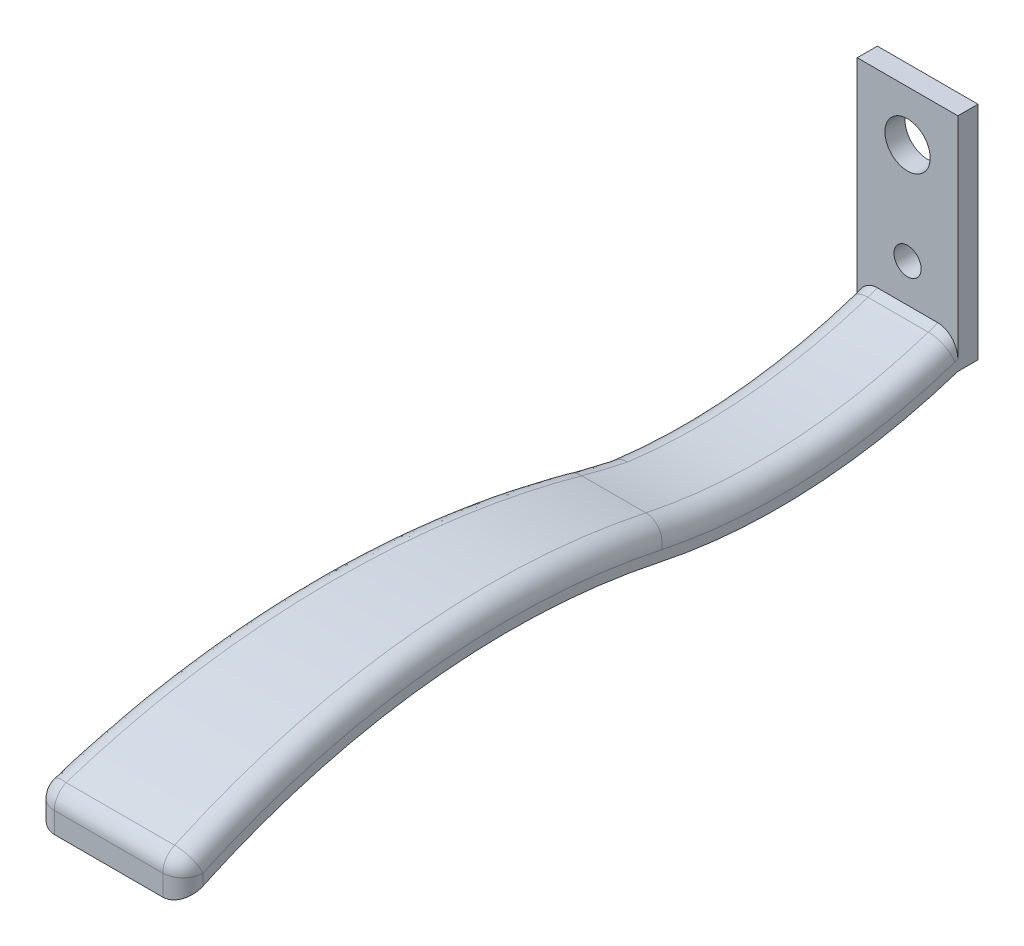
ISO-10303-21;
HEADER;
FILE_DESCRIPTION(('STEP AP214'),'2;1');
FILE_NAME('part.step','',(''),(''),'','','');
FILE_SCHEMA(('AUTOMOTIVE_DESIGN { 1 0 10303 214 1 1 1 1 }'));
ENDSEC;
DATA;
#1=APPLICATION_CONTEXT('core data for automotive mechanical design processes');
#2=APPLICATION_PROTOCOL_DEFINITION('international standard','automotive_design',2000,#1);
#3=PRODUCT_CONTEXT('',#1,'mechanical');
#4=PRODUCT('Part','Part','',(#3));
#5=PRODUCT_RELATED_PRODUCT_CATEGORY('part','',(#4));
#6=PRODUCT_DEFINITION_FORMATION('','',#4);
#7=PRODUCT_DEFINITION_CONTEXT('part definition',#1,'design');
#8=PRODUCT_DEFINITION('design','',#6,#7);
#9=PRODUCT_DEFINITION_SHAPE('','',#8);
#10=(LENGTH_UNIT() NAMED_UNIT(*) SI_UNIT(.MILLI.,.METRE.));
#11=(NAMED_UNIT(*) PLANE_ANGLE_UNIT() SI_UNIT($,.RADIAN.));
#12=(NAMED_UNIT(*) SI_UNIT($,.STERADIAN.) SOLID_ANGLE_UNIT());
#13=UNCERTAINTY_MEASURE_WITH_UNIT(LENGTH_MEASURE(1.E-05),#10,'distance_accuracy_value','');
#14=(GEOMETRIC_REPRESENTATION_CONTEXT(3) GLOBAL_UNCERTAINTY_ASSIGNED_CONTEXT((#13)) GLOBAL_UNIT_ASSIGNED_CONTEXT((#10,
#11,#12)) REPRESENTATION_CONTEXT('',''));
#15=CARTESIAN_POINT('',(0.,0.,0.));
#16=DIRECTION('',(0.,0.,1.));
#17=DIRECTION('',(1.,0.,0.));
#18=AXIS2_PLACEMENT_3D('',#15,#16,#17);
#19=CARTESIAN_POINT('',(0.,0.,1.27));
#20=DIRECTION('',(0.,0.,-1.));
#21=DIRECTION('',(1.,0.,0.));
#22=AXIS2_PLACEMENT_3D('',#19,#20,#21);
#23=PLANE('',#22);
#24=CARTESIAN_POINT('',(0.,7.62,1.26999999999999));
#25=DIRECTION('',(0.,0.,1.));
#26=DIRECTION('',(1.,0.,0.));
#27=AXIS2_PLACEMENT_3D('',#24,#25,#26);
#28=CIRCLE('',#27,2.8575);
#29=CARTESIAN_POINT('',(2.8575,7.62,1.26999999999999));
#30=VERTEX_POINT('',#29);
#31=EDGE_CURVE('E618',#30,#30,#28,.T.);
#32=ORIENTED_EDGE('',*,*,#31,.F.);
#33=EDGE_LOOP('',(#32));
#34=FACE_BOUND('',#33,.T.);
#35=CARTESIAN_POINT('',(0.,-5.08,1.27));
#36=DIRECTION('',(0.,0.,-1.));
#37=DIRECTION('',(-1.,0.,0.));
#38=AXIS2_PLACEMENT_3D('',#35,#36,#37);
#39=CIRCLE('',#38,1.7145);
#40=CARTESIAN_POINT('',(-1.7145,-5.08,1.27));
#41=VERTEX_POINT('',#40);
#42=EDGE_CURVE('E218',#41,#41,#39,.T.);
#43=ORIENTED_EDGE('',*,*,#42,.T.);
#44=EDGE_LOOP('',(#43));
#45=FACE_BOUND('',#44,.T.);
#46=DIRECTION('',(1.,0.,0.));
#47=VECTOR('',#46,1.);
#48=CARTESIAN_POINT('',(-106.820495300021,-9.906,1.27));
#49=LINE('',#48,#47);
#50=CARTESIAN_POINT('',(-3.80999999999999,-9.906,1.27));
#51=VERTEX_POINT('',#50);
#52=CARTESIAN_POINT('',(3.80999999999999,-9.906,1.27));
#53=VERTEX_POINT('',#52);
#54=EDGE_CURVE('E248',#51,#53,#49,.T.);
#55=ORIENTED_EDGE('',*,*,#54,.T.);
#56=CARTESIAN_POINT('',(6.35,-12.6282547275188,1.27));
#57=CARTESIAN_POINT('',(6.34999711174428,-12.5479668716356,1.27));
#58=CARTESIAN_POINT('',(6.3466152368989,-12.4677189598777,1.27));
#59=CARTESIAN_POINT('',(6.33313923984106,-12.3077895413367,1.27));
#60=CARTESIAN_POINT('',(6.32304519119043,-12.2281080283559,1.27));
#61=CARTESIAN_POINT('',(6.2827687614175,-11.9906726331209,1.27));
#62=CARTESIAN_POINT('',(6.24259205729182,-11.834494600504,1.27));
#63=CARTESIAN_POINT('',(6.13652316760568,-11.5310794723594,1.27));
#64=CARTESIAN_POINT('',(6.07061374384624,-11.3838484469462,1.27));
#65=CARTESIAN_POINT('',(5.9145106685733,-11.1028840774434,1.27));
#66=CARTESIAN_POINT('',(5.82432776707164,-10.9691447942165,1.27));
#67=CARTESIAN_POINT('',(5.6239002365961,-10.7224425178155,1.27));
#68=CARTESIAN_POINT('',(5.51413807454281,-10.6090887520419,1.27));
#69=CARTESIAN_POINT('',(5.27595873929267,-10.4039635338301,1.27));
#70=CARTESIAN_POINT('',(5.14754336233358,-10.3121900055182,1.27));
#71=CARTESIAN_POINT('',(4.8845362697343,-10.1595174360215,1.27));
#72=CARTESIAN_POINT('',(4.75089790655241,-10.096991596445,1.27));
#73=CARTESIAN_POINT('',(4.54384448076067,-10.0222517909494,1.27));
#74=CARTESIAN_POINT('',(4.47374619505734,-10.0005164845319,1.27));
#75=CARTESIAN_POINT('',(4.33185311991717,-9.96360684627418,1.27));
#76=CARTESIAN_POINT('',(4.26005917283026,-9.94842932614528,1.27));
#77=CARTESIAN_POINT('',(4.1252688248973,-9.92644710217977,1.27));
#78=CARTESIAN_POINT('',(4.06241080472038,-9.918781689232,1.27));
#79=CARTESIAN_POINT('',(3.93637093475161,-9.90855804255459,1.27));
#80=CARTESIAN_POINT('',(3.87318967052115,-9.90599258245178,1.27));
#81=CARTESIAN_POINT('',(3.80999999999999,-9.90600000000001,1.27));
#82=B_SPLINE_CURVE_WITH_KNOTS('',3,(#56,#57,#58,#59,#60,#61,#62,#63,#64,#65,#66,#67,#68,#69,#70,
#71,#72,#73,#74,#75,#76,#77,#78,#79,#80,#81),.UNSPECIFIED.,.F.,.F.,(4,2,2,2,2,2,2,2,2,2,2,2,4),
(0.,0.240713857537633,0.481425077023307,0.962748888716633,1.44439569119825,1.92582953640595,
2.39672273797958,2.86757062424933,3.30762164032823,3.52753429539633,3.74733991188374,
3.93711028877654,4.12661157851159),.UNSPECIFIED.);
#83=CARTESIAN_POINT('',(6.35,-12.6282547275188,1.27));
#84=VERTEX_POINT('',#83);
#85=EDGE_CURVE('E333',#84,#53,#82,.T.);
#86=ORIENTED_EDGE('',*,*,#85,.F.);
#87=DIRECTION('',(0.,-1.,0.));
#88=VECTOR('',#87,1.);
#89=CARTESIAN_POINT('',(6.35,-13.97,1.27));
#90=LINE('',#89,#88);
#91=CARTESIAN_POINT('',(6.35,13.97,1.27));
#92=VERTEX_POINT('',#91);
#93=EDGE_CURVE('E172',#92,#84,#90,.T.);
#94=ORIENTED_EDGE('',*,*,#93,.F.);
#95=DIRECTION('',(1.,0.,0.));
#96=VECTOR('',#95,1.);
#97=CARTESIAN_POINT('',(6.35,13.97,1.27));
#98=LINE('',#97,#96);
#99=CARTESIAN_POINT('',(-6.35,13.97,1.27));
#100=VERTEX_POINT('',#99);
#101=EDGE_CURVE('E205',#100,#92,#98,.T.);
#102=ORIENTED_EDGE('',*,*,#101,.F.);
#103=DIRECTION('',(0.,1.,0.));
#104=VECTOR('',#103,1.);
#105=CARTESIAN_POINT('',(-6.35,-13.97,1.27));
#106=LINE('',#105,#104);
#107=CARTESIAN_POINT('',(-6.35,-12.6282547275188,1.27));
#108=VERTEX_POINT('',#107);
#109=EDGE_CURVE('E202',#108,#100,#106,.T.);
#110=ORIENTED_EDGE('',*,*,#109,.F.);
#111=CARTESIAN_POINT('',(-3.80999999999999,-9.90600000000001,1.27));
#112=CARTESIAN_POINT('',(-3.87761320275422,-9.90598905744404,1.27));
#113=CARTESIAN_POINT('',(-3.94522104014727,-9.90892841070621,1.27));
#114=CARTESIAN_POINT('',(-4.07991645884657,-9.92062369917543,1.27));
#115=CARTESIAN_POINT('',(-4.14700415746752,-9.92937828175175,1.27));
#116=CARTESIAN_POINT('',(-4.27998009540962,-9.95258491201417,1.27));
#117=CARTESIAN_POINT('',(-4.34587135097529,-9.96701963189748,1.27));
#118=CARTESIAN_POINT('',(-4.47617796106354,-10.0014147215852,1.27));
#119=CARTESIAN_POINT('',(-4.54059327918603,-10.0213752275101,1.27));
#120=CARTESIAN_POINT('',(-4.73090251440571,-10.0892399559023,1.27));
#121=CARTESIAN_POINT('',(-4.85403654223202,-10.1451587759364,1.27));
#122=CARTESIAN_POINT('',(-5.08958562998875,-10.276164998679,1.27));
#123=CARTESIAN_POINT('',(-5.20199521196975,-10.3512621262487,1.27));
#124=CARTESIAN_POINT('',(-5.41745252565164,-10.5210401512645,1.27));
#125=CARTESIAN_POINT('',(-5.52002774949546,-10.6163203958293,1.27));
#126=CARTESIAN_POINT('',(-5.7090552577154,-10.8217006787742,1.27));
#127=CARTESIAN_POINT('',(-5.79550265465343,-10.93180519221,1.27));
#128=CARTESIAN_POINT('',(-5.95639037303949,-11.1722575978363,1.27));
#129=CARTESIAN_POINT('',(-6.02950102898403,-11.3034952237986,1.27));
#130=CARTESIAN_POINT('',(-6.15402366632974,-11.5758969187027,1.27));
#131=CARTESIAN_POINT('',(-6.20543213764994,-11.7170625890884,1.27));
#132=CARTESIAN_POINT('',(-6.2801296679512,-11.9861074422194,1.27));
#133=CARTESIAN_POINT('',(-6.30628133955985,-12.1132015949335,1.27));
#134=CARTESIAN_POINT('',(-6.34122058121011,-12.3696054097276,1.27));
#135=CARTESIAN_POINT('',(-6.35002794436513,-12.4989123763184,1.27));
#136=CARTESIAN_POINT('',(-6.34999999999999,-12.6282547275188,1.27));
#137=B_SPLINE_CURVE_WITH_KNOTS('',3,(#111,#112,#113,#114,#115,#116,#117,#118,#119,#120,#121,
#122,#123,#124,#125,#126,#127,#128,#129,#130,#131,#132,#133,#134,#135,#136),.UNSPECIFIED.,.F.,
.F.,(4,2,2,2,2,2,2,2,2,2,2,2,4),(0.,0.202766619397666,0.405486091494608,0.607591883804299,
0.80970265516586,1.21339222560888,1.61728690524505,2.03548484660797,2.45380931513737,
2.90254344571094,3.35135012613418,3.73946028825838,4.12712728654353),.UNSPECIFIED.);
#138=EDGE_CURVE('E342',#51,#108,#137,.T.);
#139=ORIENTED_EDGE('',*,*,#138,.F.);
#140=EDGE_LOOP('',(#55,#86,#94,#102,#110,#139));
#141=FACE_BOUND('',#140,.T.);
#142=ADVANCED_FACE('F34',(#34,#45,#141),#23,.F.);
#143=CARTESIAN_POINT('',(-6.35,-13.97,1.27));
#144=DIRECTION('',(1.,0.,0.));
#145=DIRECTION('',(0.,0.,1.));
#146=AXIS2_PLACEMENT_3D('',#143,#144,#145);
#147=PLANE('',#146);
#148=ORIENTED_EDGE('',*,*,#109,.T.);
#149=DIRECTION('',(0.,0.,-1.));
#150=VECTOR('',#149,1.);
#151=CARTESIAN_POINT('',(-6.35,13.97,1.27));
#152=LINE('',#151,#150);
#153=CARTESIAN_POINT('',(-6.35,13.97,-1.27));
#154=VERTEX_POINT('',#153);
#155=EDGE_CURVE('E199',#100,#154,#152,.T.);
#156=ORIENTED_EDGE('',*,*,#155,.T.);
#157=DIRECTION('',(0.,1.,0.));
#158=VECTOR('',#157,1.);
#159=CARTESIAN_POINT('',(-6.35,-13.97,-1.27));
#160=LINE('',#159,#158);
#161=CARTESIAN_POINT('',(-6.35,-13.97,-1.27));
#162=VERTEX_POINT('',#161);
#163=EDGE_CURVE('E189',#162,#154,#160,.T.);
#164=ORIENTED_EDGE('',*,*,#163,.F.);
#165=DIRECTION('',(0.,0.,-1.));
#166=VECTOR('',#165,1.);
#167=CARTESIAN_POINT('',(-6.35,-13.97,1.27));
#168=LINE('',#167,#166);
#169=CARTESIAN_POINT('',(-6.35,-13.97,1.27));
#170=VERTEX_POINT('',#169);
#171=EDGE_CURVE('E165',#170,#162,#168,.T.);
#172=ORIENTED_EDGE('',*,*,#171,.F.);
#173=CARTESIAN_POINT('',(-6.34999999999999,54.8081430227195,23.8505035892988));
#174=DIRECTION('',(-1.,0.,0.));
#175=DIRECTION('',(0.,0.,1.));
#176=AXIS2_PLACEMENT_3D('',#173,#174,#175);
#177=CIRCLE('',#176,72.39);
#178=CARTESIAN_POINT('',(-6.35,-16.9987677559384,33.02));
#179=VERTEX_POINT('',#178);
#180=EDGE_CURVE('E175',#179,#170,#177,.F.);
#181=ORIENTED_EDGE('',*,*,#180,.F.);
#182=DIRECTION('',(0.,1.,0.));
#183=VECTOR('',#182,1.);
#184=CARTESIAN_POINT('',(-6.35,-23.798486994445,33.02));
#185=LINE('',#184,#183);
#186=CARTESIAN_POINT('',(-6.35,-15.7182685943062,33.02));
#187=VERTEX_POINT('',#186);
#188=EDGE_CURVE('E612',#179,#187,#185,.T.);
#189=ORIENTED_EDGE('',*,*,#188,.T.);
#190=CARTESIAN_POINT('',(-6.35,54.8081430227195,23.8505035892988));
#191=DIRECTION('',(-1.,0.,0.));
#192=DIRECTION('',(0.,0.,1.));
#193=AXIS2_PLACEMENT_3D('',#190,#191,#192);
#194=CIRCLE('',#193,71.12);
#195=CARTESIAN_POINT('',(-6.35,-12.7633659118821,1.66614918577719));
#196=VERTEX_POINT('',#195);
#197=EDGE_CURVE('E201',#196,#187,#194,.T.);
#198=ORIENTED_EDGE('',*,*,#197,.F.);
#199=CARTESIAN_POINT('',(-6.35,4.57617815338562,7.35888265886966));
#200=DIRECTION('',(-1.,0.,0.));
#201=DIRECTION('',(0.,0.,1.));
#202=AXIS2_PLACEMENT_3D('',#199,#200,#201);
#203=CIRCLE('',#202,18.2501233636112);
#204=EDGE_CURVE('E252',#108,#196,#203,.T.);
#205=ORIENTED_EDGE('',*,*,#204,.F.);
#206=EDGE_LOOP('',(#148,#156,#164,#172,#181,#189,#198,#205));
#207=FACE_BOUND('',#206,.T.);
#208=ADVANCED_FACE('F186',(#207),#147,.F.);
#209=CARTESIAN_POINT('',(6.35,13.97,1.27));
#210=DIRECTION('',(0.,-1.,0.));
#211=DIRECTION('',(0.,0.,-1.));
#212=AXIS2_PLACEMENT_3D('',#209,#210,#211);
#213=PLANE('',#212);
#214=DIRECTION('',(1.,0.,0.));
#215=VECTOR('',#214,1.);
#216=CARTESIAN_POINT('',(6.35,13.97,-1.27));
#217=LINE('',#216,#215);
#218=CARTESIAN_POINT('',(6.35,13.97,-1.27));
#219=VERTEX_POINT('',#218);
#220=EDGE_CURVE('E217',#154,#219,#217,.T.);
#221=ORIENTED_EDGE('',*,*,#220,.F.);
#222=ORIENTED_EDGE('',*,*,#155,.F.);
#223=ORIENTED_EDGE('',*,*,#101,.T.);
#224=DIRECTION('',(0.,0.,-1.));
#225=VECTOR('',#224,1.);
#226=CARTESIAN_POINT('',(6.35,13.97,1.27));
#227=LINE('',#226,#225);
#228=EDGE_CURVE('E191',#92,#219,#227,.T.);
#229=ORIENTED_EDGE('',*,*,#228,.T.);
#230=EDGE_LOOP('',(#221,#222,#223,#229));
#231=FACE_BOUND('',#230,.T.);
#232=ADVANCED_FACE('F227',(#231),#213,.F.);
#233=CARTESIAN_POINT('',(6.35,-13.97,1.27));
#234=DIRECTION('',(-1.,0.,0.));
#235=DIRECTION('',(0.,0.,-1.));
#236=AXIS2_PLACEMENT_3D('',#233,#234,#235);
#237=PLANE('',#236);
#238=CARTESIAN_POINT('',(6.35,-105.446391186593,57.890967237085));
#239=DIRECTION('',(1.,0.,0.));
#240=DIRECTION('',(0.,0.,-1.));
#241=AXIS2_PLACEMENT_3D('',#238,#239,#240);
#242=CIRCLE('',#241,91.44);
#243=CARTESIAN_POINT('',(6.35,-16.002,38.8916386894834));
#244=VERTEX_POINT('',#243);
#245=CARTESIAN_POINT('',(6.35,-22.566529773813,96.52));
#246=VERTEX_POINT('',#245);
#247=EDGE_CURVE('E237',#244,#246,#242,.T.);
#248=ORIENTED_EDGE('',*,*,#247,.F.);
#249=CARTESIAN_POINT('',(6.35,54.8081430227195,23.8505035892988));
#250=DIRECTION('',(-1.,0.,0.));
#251=DIRECTION('',(0.,0.,1.));
#252=AXIS2_PLACEMENT_3D('',#249,#250,#251);
#253=CIRCLE('',#252,72.39);
#254=CARTESIAN_POINT('',(6.35,-13.97,1.27));
#255=VERTEX_POINT('',#254);
#256=EDGE_CURVE('E183',#255,#244,#253,.T.);
#257=ORIENTED_EDGE('',*,*,#256,.F.);
#258=DIRECTION('',(0.,0.,-1.));
#259=VECTOR('',#258,1.);
#260=CARTESIAN_POINT('',(6.35,-13.97,1.27));
#261=LINE('',#260,#259);
#262=CARTESIAN_POINT('',(6.35,-13.97,-1.27));
#263=VERTEX_POINT('',#262);
#264=EDGE_CURVE('E168',#255,#263,#261,.T.);
#265=ORIENTED_EDGE('',*,*,#264,.T.);
#266=DIRECTION('',(0.,-1.,0.));
#267=VECTOR('',#266,1.);
#268=CARTESIAN_POINT('',(6.35,-13.97,-1.27));
#269=LINE('',#268,#267);
#270=EDGE_CURVE('E220',#219,#263,#269,.T.);
#271=ORIENTED_EDGE('',*,*,#270,.F.);
#272=ORIENTED_EDGE('',*,*,#228,.F.);
#273=ORIENTED_EDGE('',*,*,#93,.T.);
#274=CARTESIAN_POINT('',(6.35,4.57617815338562,7.35888265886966));
#275=DIRECTION('',(1.,0.,0.));
#276=DIRECTION('',(0.,0.,-1.));
#277=AXIS2_PLACEMENT_3D('',#274,#275,#276);
#278=CIRCLE('',#277,18.2501233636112);
#279=CARTESIAN_POINT('',(6.35,-12.7633659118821,1.66614918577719));
#280=VERTEX_POINT('',#279);
#281=EDGE_CURVE('E698',#280,#84,#278,.T.);
#282=ORIENTED_EDGE('',*,*,#281,.F.);
#283=CARTESIAN_POINT('',(6.35,54.8081430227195,23.8505035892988));
#284=DIRECTION('',(1.,0.,0.));
#285=DIRECTION('',(0.,0.,-1.));
#286=AXIS2_PLACEMENT_3D('',#283,#284,#285);
#287=CIRCLE('',#286,71.12);
#288=CARTESIAN_POINT('',(6.35,-14.7597167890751,38.6277591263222));
#289=VERTEX_POINT('',#288);
#290=EDGE_CURVE('E696',#289,#280,#287,.T.);
#291=ORIENTED_EDGE('',*,*,#290,.F.);
#292=CARTESIAN_POINT('',(6.35,-105.446391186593,57.890967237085));
#293=DIRECTION('',(1.,0.,0.));
#294=DIRECTION('',(0.,0.,-1.));
#295=AXIS2_PLACEMENT_3D('',#292,#293,#294);
#296=CIRCLE('',#295,92.71);
#297=CARTESIAN_POINT('',(6.35,-21.1674381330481,96.52));
#298=VERTEX_POINT('',#297);
#299=EDGE_CURVE('E680',#298,#289,#296,.F.);
#300=ORIENTED_EDGE('',*,*,#299,.F.);
#301=DIRECTION('',(0.,1.,0.));
#302=VECTOR('',#301,1.);
#303=CARTESIAN_POINT('',(6.35,-13.97,96.52));
#304=LINE('',#303,#302);
#305=EDGE_CURVE('E640',#246,#298,#304,.T.);
#306=ORIENTED_EDGE('',*,*,#305,.F.);
#307=EDGE_LOOP('',(#248,#257,#265,#271,#272,#273,#282,#291,#300,#306));
#308=FACE_BOUND('',#307,.T.);
#309=ADVANCED_FACE('F232',(#308),#237,.F.);
#310=CARTESIAN_POINT('',(6.35,-13.97,1.27));
#311=DIRECTION('',(0.,1.,0.));
#312=DIRECTION('',(0.,0.,1.));
#313=AXIS2_PLACEMENT_3D('',#310,#311,#312);
#314=PLANE('',#313);
#315=DIRECTION('',(-1.,0.,0.));
#316=VECTOR('',#315,1.);
#317=CARTESIAN_POINT('',(6.35,-13.97,-1.27));
#318=LINE('',#317,#316);
#319=EDGE_CURVE('E194',#263,#162,#318,.T.);
#320=ORIENTED_EDGE('',*,*,#319,.F.);
#321=ORIENTED_EDGE('',*,*,#264,.F.);
#322=DIRECTION('',(-1.,0.,0.));
#323=VECTOR('',#322,1.);
#324=CARTESIAN_POINT('',(6.35,-13.97,1.27));
#325=LINE('',#324,#323);
#326=EDGE_CURVE('E161',#255,#170,#325,.T.);
#327=ORIENTED_EDGE('',*,*,#326,.T.);
#328=ORIENTED_EDGE('',*,*,#171,.T.);
#329=EDGE_LOOP('',(#320,#321,#327,#328));
#330=FACE_BOUND('',#329,.T.);
#331=ADVANCED_FACE('F163',(#330),#314,.F.);
#332=CARTESIAN_POINT('',(0.,0.,-1.27));
#333=DIRECTION('',(0.,0.,-1.));
#334=DIRECTION('',(1.,0.,0.));
#335=AXIS2_PLACEMENT_3D('',#332,#333,#334);
#336=PLANE('',#335);
#337=CARTESIAN_POINT('',(0.,7.62,-1.27));
#338=DIRECTION('',(0.,0.,1.));
#339=DIRECTION('',(1.,0.,0.));
#340=AXIS2_PLACEMENT_3D('',#337,#338,#339);
#341=CIRCLE('',#340,2.8575);
#342=CARTESIAN_POINT('',(2.8575,7.62,-1.27));
#343=VERTEX_POINT('',#342);
#344=EDGE_CURVE('E648',#343,#343,#341,.T.);
#345=ORIENTED_EDGE('',*,*,#344,.T.);
#346=EDGE_LOOP('',(#345));
#347=FACE_BOUND('',#346,.T.);
#348=CARTESIAN_POINT('',(0.,-5.08,-1.27));
#349=DIRECTION('',(0.,0.,1.));
#350=DIRECTION('',(1.,0.,0.));
#351=AXIS2_PLACEMENT_3D('',#348,#349,#350);
#352=CIRCLE('',#351,1.7145);
#353=CARTESIAN_POINT('',(1.7145,-5.08,-1.27));
#354=VERTEX_POINT('',#353);
#355=EDGE_CURVE('E211',#354,#354,#352,.F.);
#356=ORIENTED_EDGE('',*,*,#355,.F.);
#357=EDGE_LOOP('',(#356));
#358=FACE_BOUND('',#357,.T.);
#359=ORIENTED_EDGE('',*,*,#163,.T.);
#360=ORIENTED_EDGE('',*,*,#220,.T.);
#361=ORIENTED_EDGE('',*,*,#270,.T.);
#362=ORIENTED_EDGE('',*,*,#319,.T.);
#363=EDGE_LOOP('',(#359,#360,#361,#362));
#364=FACE_BOUND('',#363,.T.);
#365=ADVANCED_FACE('F223',(#347,#358,#364),#336,.T.);
#366=CARTESIAN_POINT('',(0.,-5.08,-1.271));
#367=DIRECTION('',(0.,0.,1.));
#368=DIRECTION('',(-1.,0.,0.));
#369=AXIS2_PLACEMENT_3D('',#366,#367,#368);
#370=CYLINDRICAL_SURFACE('',#369,1.7145);
#371=ORIENTED_EDGE('',*,*,#355,.T.);
#372=EDGE_LOOP('',(#371));
#373=FACE_BOUND('',#372,.T.);
#374=ORIENTED_EDGE('',*,*,#42,.F.);
#375=EDGE_LOOP('',(#374));
#376=FACE_BOUND('',#375,.T.);
#377=ADVANCED_FACE('F358',(#373,#376),#370,.F.);
#378=CARTESIAN_POINT('',(-106.820495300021,54.8081430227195,23.8505035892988));
#379=DIRECTION('',(1.,0.,0.));
#380=DIRECTION('',(0.,0.,1.));
#381=AXIS2_PLACEMENT_3D('',#378,#379,#380);
#382=CYLINDRICAL_SURFACE('',#381,72.39);
#383=CARTESIAN_POINT('',(-6.86821894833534,-16.002,38.8916386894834));
#384=CARTESIAN_POINT('',(-6.78170074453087,-16.2083986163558,37.9198816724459));
#385=CARTESIAN_POINT('',(-6.69525673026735,-16.3946619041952,36.9446999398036));
#386=CARTESIAN_POINT('',(-6.52251708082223,-16.7269178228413,34.9874870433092));
#387=CARTESIAN_POINT('',(-6.43622144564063,-16.872910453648,34.0054558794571));
#388=CARTESIAN_POINT('',(-6.34999999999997,-16.9987677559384,33.0200000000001));
#389=B_SPLINE_CURVE_WITH_KNOTS('',3,(#383,#384,#385,#386,#387,#388),.UNSPECIFIED.,.F.,.F.,(4,2,
4),(0.,2.98970131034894,5.9794026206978),.UNSPECIFIED.);
#390=CARTESIAN_POINT('',(-6.86821894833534,-16.002,38.8916386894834));
#391=VERTEX_POINT('',#390);
#392=EDGE_CURVE('E179',#391,#179,#389,.T.);
#393=ORIENTED_EDGE('',*,*,#392,.T.);
#394=ORIENTED_EDGE('',*,*,#180,.T.);
#395=ORIENTED_EDGE('',*,*,#326,.F.);
#396=ORIENTED_EDGE('',*,*,#256,.T.);
#397=DIRECTION('',(1.,0.,0.));
#398=VECTOR('',#397,1.);
#399=CARTESIAN_POINT('',(-106.820495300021,-16.002,38.8916386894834));
#400=LINE('',#399,#398);
#401=EDGE_CURVE('E239',#391,#244,#400,.T.);
#402=ORIENTED_EDGE('',*,*,#401,.F.);
#403=EDGE_LOOP('',(#393,#394,#395,#396,#402));
#404=FACE_BOUND('',#403,.T.);
#405=ADVANCED_FACE('F176',(#404),#382,.T.);
#406=CARTESIAN_POINT('',(-106.820495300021,4.57617815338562,7.35888265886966));
#407=DIRECTION('',(1.,0.,0.));
#408=DIRECTION('',(0.,0.,1.));
#409=AXIS2_PLACEMENT_3D('',#406,#407,#408);
#410=CYLINDRICAL_SURFACE('',#409,15.7101233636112);
#411=DIRECTION('',(1.,0.,0.));
#412=VECTOR('',#411,1.);
#413=CARTESIAN_POINT('',(-106.820495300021,-10.3500977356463,2.45844755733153));
#414=LINE('',#413,#412);
#415=CARTESIAN_POINT('',(-3.80999999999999,-10.3500977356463,2.45844755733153));
#416=VERTEX_POINT('',#415);
#417=CARTESIAN_POINT('',(3.80999999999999,-10.3500977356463,2.45844755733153));
#418=VERTEX_POINT('',#417);
#419=EDGE_CURVE('E245',#416,#418,#414,.T.);
#420=ORIENTED_EDGE('',*,*,#419,.T.);
#421=CARTESIAN_POINT('',(3.80999999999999,4.57617815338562,7.35888265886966));
#422=DIRECTION('',(1.,0.,0.));
#423=DIRECTION('',(0.,0.,-1.));
#424=AXIS2_PLACEMENT_3D('',#421,#422,#423);
#425=CIRCLE('',#424,15.7101233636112);
#426=EDGE_CURVE('E254',#53,#418,#425,.F.);
#427=ORIENTED_EDGE('',*,*,#426,.F.);
#428=ORIENTED_EDGE('',*,*,#54,.F.);
#429=CARTESIAN_POINT('',(-3.80999999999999,4.57617815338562,7.35888265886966));
#430=DIRECTION('',(-1.,0.,0.));
#431=DIRECTION('',(0.,0.,1.));
#432=AXIS2_PLACEMENT_3D('',#429,#430,#431);
#433=CIRCLE('',#432,15.7101233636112);
#434=EDGE_CURVE('E257',#416,#51,#433,.F.);
#435=ORIENTED_EDGE('',*,*,#434,.F.);
#436=EDGE_LOOP('',(#420,#427,#428,#435));
#437=FACE_BOUND('',#436,.T.);
#438=ADVANCED_FACE('F625',(#437),#410,.F.);
#439=CARTESIAN_POINT('',(-106.820495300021,54.8081430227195,23.8505035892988));
#440=DIRECTION('',(1.,0.,0.));
#441=DIRECTION('',(0.,0.,1.));
#442=AXIS2_PLACEMENT_3D('',#439,#440,#441);
#443=CYLINDRICAL_SURFACE('',#442,68.58);
#444=DIRECTION('',(1.,0.,0.));
#445=VECTOR('',#444,1.);
#446=CARTESIAN_POINT('',(-106.820495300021,-12.2751503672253,38.1));
#447=LINE('',#446,#445);
#448=CARTESIAN_POINT('',(-4.29471177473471,-12.2751503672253,38.1));
#449=VERTEX_POINT('',#448);
#450=CARTESIAN_POINT('',(3.80999999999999,-12.2751503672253,38.1));
#451=VERTEX_POINT('',#450);
#452=EDGE_CURVE('E590',#449,#451,#447,.T.);
#453=ORIENTED_EDGE('',*,*,#452,.T.);
#454=CARTESIAN_POINT('',(3.80999999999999,54.8081430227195,23.8505035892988));
#455=DIRECTION('',(1.,0.,0.));
#456=DIRECTION('',(0.,0.,-1.));
#457=AXIS2_PLACEMENT_3D('',#454,#455,#456);
#458=CIRCLE('',#457,68.58);
#459=EDGE_CURVE('E688',#418,#451,#458,.F.);
#460=ORIENTED_EDGE('',*,*,#459,.F.);
#461=ORIENTED_EDGE('',*,*,#419,.F.);
#462=CARTESIAN_POINT('',(-3.80999999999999,54.8081430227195,23.8505035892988));
#463=DIRECTION('',(-1.,0.,0.));
#464=DIRECTION('',(0.,0.,1.));
#465=AXIS2_PLACEMENT_3D('',#462,#463,#464);
#466=CIRCLE('',#465,68.58);
#467=CARTESIAN_POINT('',(-3.80999999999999,-13.1854814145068,32.799438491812));
#468=VERTEX_POINT('',#467);
#469=EDGE_CURVE('E691',#468,#416,#466,.F.);
#470=ORIENTED_EDGE('',*,*,#469,.F.);
#471=CARTESIAN_POINT('',(-6.33749377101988,-3.74482984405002,59.5543656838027));
#472=CARTESIAN_POINT('',(-8.74782783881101,-3.84632407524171,59.3879190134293));
#473=CARTESIAN_POINT('',(-8.86617283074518,-5.91345846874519,60.6371850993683));
#474=CARTESIAN_POINT('',(-6.25524483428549,-4.25534002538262,58.7171453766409));
#475=CARTESIAN_POINT('',(-8.66849623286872,-4.35553050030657,58.5474811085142));
#476=CARTESIAN_POINT('',(-8.78397797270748,-6.44287643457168,59.7695274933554));
#477=CARTESIAN_POINT('',(-6.17223305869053,-4.74779681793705,57.8691341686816));
#478=CARTESIAN_POINT('',(-8.58847864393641,-4.8462309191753,57.6968248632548));
#479=CARTESIAN_POINT('',(-8.70102077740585,-6.95357236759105,58.8906866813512));
#480=CARTESIAN_POINT('',(-6.00485902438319,-5.69586103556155,56.1528762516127));
#481=CARTESIAN_POINT('',(-8.42714863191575,-5.79059408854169,55.9754906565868));
#482=CARTESIAN_POINT('',(-8.53375679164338,-7.93675007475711,57.1120338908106));
#483=CARTESIAN_POINT('',(-5.92049676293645,-6.15146838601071,55.2846295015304));
#484=CARTESIAN_POINT('',(-8.34583343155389,-6.2442181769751,55.1047754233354));
#485=CARTESIAN_POINT('',(-8.44944999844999,-8.40923177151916,56.2122218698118));
#486=CARTESIAN_POINT('',(-5.6657010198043,-7.46162443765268,52.6521130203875));
#487=CARTESIAN_POINT('',(-8.10009862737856,-7.5489731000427,52.4635725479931));
#488=CARTESIAN_POINT('',(-8.19482178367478,-9.76791212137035,53.4839997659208));
#489=CARTESIAN_POINT('',(-5.49350658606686,-8.25982941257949,50.8595383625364));
#490=CARTESIAN_POINT('',(-7.93413074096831,-8.3424349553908,50.6665763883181));
#491=CARTESIAN_POINT('',(-8.02274056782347,-10.5956802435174,51.6262557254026));
#492=CARTESIAN_POINT('',(-5.15088635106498,-9.67975294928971,47.2633774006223));
#493=CARTESIAN_POINT('',(-7.6039364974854,-9.75263107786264,47.0629562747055));
#494=CARTESIAN_POINT('',(-7.68034560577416,-12.0681935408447,47.8993556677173));
#495=CARTESIAN_POINT('',(-4.98054250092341,-10.3057275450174,45.4614547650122));
#496=CARTESIAN_POINT('',(-7.43976718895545,-10.3733210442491,45.2576652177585));
#497=CARTESIAN_POINT('',(-7.51011375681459,-12.7173523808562,46.0319238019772));
#498=CARTESIAN_POINT('',(-4.63838649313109,-11.4054330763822,41.8118577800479));
#499=CARTESIAN_POINT('',(-7.11002412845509,-11.4623364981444,41.6024321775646));
#500=CARTESIAN_POINT('',(-7.16818271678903,-13.8577877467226,42.2496450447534));
#501=CARTESIAN_POINT('',(-4.46657438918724,-11.8791695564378,39.9641850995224));
#502=CARTESIAN_POINT('',(-6.94444775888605,-11.9302871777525,39.7523901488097));
#503=CARTESIAN_POINT('',(-6.99648357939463,-14.3490700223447,40.3347998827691));
#504=CARTESIAN_POINT('',(-4.12279451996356,-12.6712570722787,36.2352222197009));
#505=CARTESIAN_POINT('',(-6.61314194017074,-12.7108747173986,36.0197763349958));
#506=CARTESIAN_POINT('',(-6.6529297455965,-15.1704941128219,36.4702698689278));
#507=CARTESIAN_POINT('',(-3.95082672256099,-12.9895586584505,34.3539215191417));
#508=CARTESIAN_POINT('',(-6.44741691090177,-13.0230665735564,34.13716834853));
#509=CARTESIAN_POINT('',(-6.48107501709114,-15.5005846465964,34.5205741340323));
#510=CARTESIAN_POINT('',(-3.608100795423,-13.4683768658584,30.5712496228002));
#511=CARTESIAN_POINT('',(-6.11711521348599,-13.4899263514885,30.3529217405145));
#512=CARTESIAN_POINT('',(-6.13857443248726,-15.9971368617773,30.6003825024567));
#513=CARTESIAN_POINT('',(-3.43734271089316,-13.6288876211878,28.6698776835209));
#514=CARTESIAN_POINT('',(-5.95254946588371,-13.6441920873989,28.4513283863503));
#515=CARTESIAN_POINT('',(-5.9679286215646,-16.1635924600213,28.6298858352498));
#516=CARTESIAN_POINT('',(-3.09344734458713,-13.7932176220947,24.8058802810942));
#517=CARTESIAN_POINT('',(-5.6210826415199,-13.796302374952,24.5877349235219));
#518=CARTESIAN_POINT('',(-5.62425936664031,-16.3340087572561,24.6254120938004));
#519=CARTESIAN_POINT('',(-2.92037975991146,-13.7924678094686,22.8430458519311));
#520=CARTESIAN_POINT('',(-5.45427683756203,-13.7891728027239,22.6258064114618));
#521=CARTESIAN_POINT('',(-5.45130557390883,-16.3332311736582,22.5912184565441));
#522=CARTESIAN_POINT('',(-2.66370768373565,-13.6652662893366,19.9044615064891));
#523=CARTESIAN_POINT('',(-5.2070026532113,-13.6529632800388,19.6910003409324));
#524=CARTESIAN_POINT('',(-5.19480225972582,-16.2013184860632,19.545801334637));
#525=CARTESIAN_POINT('',(-2.57862543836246,-13.6018331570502,18.9257250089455));
#526=CARTESIAN_POINT('',(-5.12498526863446,-13.58650633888,18.7130904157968));
#527=CARTESIAN_POINT('',(-5.10977595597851,-16.135535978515,18.5314826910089));
#528=CARTESIAN_POINT('',(-2.40957171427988,-13.4330537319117,16.9717854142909));
#529=CARTESIAN_POINT('',(-4.96201015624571,-13.4118059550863,16.7610306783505));
#530=CARTESIAN_POINT('',(-4.94083338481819,-15.9605054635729,16.5065072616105));
#531=CARTESIAN_POINT('',(-2.32560023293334,-13.3277075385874,15.9965823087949));
#532=CARTESIAN_POINT('',(-4.88105568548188,-13.3035158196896,15.7869094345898));
#533=CARTESIAN_POINT('',(-4.85691711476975,-15.8512575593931,15.4958504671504));
#534=CARTESIAN_POINT('',(-2.24224631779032,-13.201471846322,15.0239139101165));
#535=CARTESIAN_POINT('',(-4.80073685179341,-13.1744868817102,14.8159924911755));
#536=CARTESIAN_POINT('',(-4.77361800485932,-15.7203464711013,14.4878205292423));
#537=(BOUNDED_SURFACE() B_SPLINE_SURFACE(3,2,((#471,#472,#473),(#474,#475,#476),(#477,#478,
#479),(#480,#481,#482),(#483,#484,#485),(#486,#487,#488),(#489,#490,#491),(#492,#493,#494),
(#495,#496,#497),(#498,#499,#500),(#501,#502,#503),(#504,#505,#506),(#507,#508,#509),(#510,#511,
#512),(#513,#514,#515),(#516,#517,#518),(#519,#520,#521),(#522,#523,#524),(#525,#526,#527),
(#528,#529,#530),(#531,#532,#533),(#534,#535,#536)),.UNSPECIFIED.,.F.,.F.,
.F.) B_SPLINE_SURFACE_WITH_KNOTS((4,2,2,2,2,2,2,2,2,2,4),(3,3),(0.,3.06019599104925,
6.12039817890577,12.2388762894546,18.1888054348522,24.138517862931,30.0901218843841,
36.0419471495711,42.1624293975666,45.2236301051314,48.284823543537),(0.,1.),
.UNSPECIFIED.) GEOMETRIC_REPRESENTATION_ITEM() RATIONAL_B_SPLINE_SURFACE(((1.,0.724257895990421,
1.),(1.,0.723820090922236,1.),(1.,0.723379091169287,1.),(1.,0.72249179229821,1.),(1.,
0.722045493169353,1.),(1.,0.720700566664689,1.),(1.,0.719795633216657,1.),(1.,0.718004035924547,
1.),(1.,0.717117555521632,1.),(1.,0.715346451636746,1.),(1.,0.714461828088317,1.),(1.,
0.712702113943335,1.),(1.,0.711827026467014,1.),(1.,0.710094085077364,1.),(1.,0.709236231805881,
1.),(1.,0.707520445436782,1.),(1.,0.70666319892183,1.),(1.,0.705401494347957,1.),(1.,
0.704984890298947,1.),(1.,0.704160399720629,1.),(1.,0.703752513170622,1.),(1.,0.703349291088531,1.))) REPRESENTATION_ITEM('') SURFACE());
#538=CARTESIAN_POINT('',(-6.33749377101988,-3.74482984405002,59.5543656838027));
#539=CARTESIAN_POINT('',(-6.25524483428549,-4.25534002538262,58.7171453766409));
#540=CARTESIAN_POINT('',(-6.17223305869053,-4.74779681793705,57.8691341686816));
#541=CARTESIAN_POINT('',(-6.00485902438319,-5.69586103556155,56.1528762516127));
#542=CARTESIAN_POINT('',(-5.92049676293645,-6.15146838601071,55.2846295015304));
#543=CARTESIAN_POINT('',(-5.6657010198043,-7.46162443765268,52.6521130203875));
#544=CARTESIAN_POINT('',(-5.49350658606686,-8.25982941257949,50.8595383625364));
#545=CARTESIAN_POINT('',(-5.15088635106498,-9.67975294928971,47.2633774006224));
#546=CARTESIAN_POINT('',(-4.98054250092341,-10.3057275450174,45.4614547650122));
#547=CARTESIAN_POINT('',(-4.63838649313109,-11.4054330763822,41.8118577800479));
#548=CARTESIAN_POINT('',(-4.46657438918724,-11.8791695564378,39.9641850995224));
#549=CARTESIAN_POINT('',(-4.12279451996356,-12.6712570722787,36.2352222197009));
#550=CARTESIAN_POINT('',(-3.95082672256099,-12.9895586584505,34.3539215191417));
#551=CARTESIAN_POINT('',(-3.608100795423,-13.4683768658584,30.5712496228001));
#552=CARTESIAN_POINT('',(-3.43734271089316,-13.6288876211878,28.6698776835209));
#553=CARTESIAN_POINT('',(-3.09344734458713,-13.7932176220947,24.8058802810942));
#554=CARTESIAN_POINT('',(-2.92037975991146,-13.7924678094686,22.8430458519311));
#555=CARTESIAN_POINT('',(-2.66370768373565,-13.6652662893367,19.9044615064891));
#556=CARTESIAN_POINT('',(-2.57862543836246,-13.6018331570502,18.9257250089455));
#557=CARTESIAN_POINT('',(-2.40957171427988,-13.4330537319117,16.9717854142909));
#558=CARTESIAN_POINT('',(-2.32560023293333,-13.3277075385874,15.9965823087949));
#559=CARTESIAN_POINT('',(-2.24224631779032,-13.201471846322,15.0239139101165));
#560=B_SPLINE_CURVE_WITH_KNOTS('',3,(#538,#539,#540,#541,#542,#543,#544,#545,#546,#547,#548,
#549,#550,#551,#552,#553,#554,#555,#556,#557,#558,#559),.UNSPECIFIED.,.F.,.F.,(4,2,2,2,2,2,2,2,
2,2,4),(0.,3.06019599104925,6.12039817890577,12.2388762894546,18.1888054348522,24.138517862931,
30.0901218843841,36.0419471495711,42.1624293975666,45.2236301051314,48.284823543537),.UNSPECIFIED.);
#561=EDGE_CURVE('E695',#449,#468,#560,.T.);
#562=ORIENTED_EDGE('',*,*,#561,.F.);
#563=EDGE_LOOP('',(#453,#460,#461,#470,#562));
#564=FACE_BOUND('',#563,.T.);
#565=ADVANCED_FACE('F522',(#564),#443,.F.);
#566=CARTESIAN_POINT('',(-106.820495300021,-105.446391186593,57.890967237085));
#567=DIRECTION('',(1.,0.,0.));
#568=DIRECTION('',(0.,0.,1.));
#569=AXIS2_PLACEMENT_3D('',#566,#567,#568);
#570=CYLINDRICAL_SURFACE('',#569,95.25);
#571=CARTESIAN_POINT('',(3.80999999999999,-105.446391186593,57.890967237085));
#572=DIRECTION('',(1.,0.,0.));
#573=DIRECTION('',(0.,0.,-1.));
#574=AXIS2_PLACEMENT_3D('',#571,#572,#573);
#575=CIRCLE('',#574,95.25);
#576=CARTESIAN_POINT('',(3.80999999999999,-18.8584257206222,97.5783296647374));
#577=VERTEX_POINT('',#576);
#578=EDGE_CURVE('E679',#451,#577,#575,.T.);
#579=ORIENTED_EDGE('',*,*,#578,.F.);
#580=ORIENTED_EDGE('',*,*,#452,.F.);
#581=CARTESIAN_POINT('',(-4.36215099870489,-26.261030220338,9.46867150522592));
#582=CARTESIAN_POINT('',(-4.25974636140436,-24.1793227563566,8.20943586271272));
#583=CARTESIAN_POINT('',(-1.83050859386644,-24.091568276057,8.35355421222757));
#584=CARTESIAN_POINT('',(-4.4527833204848,-25.5819715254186,10.5831521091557));
#585=CARTESIAN_POINT('',(-4.35234031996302,-23.4804854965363,9.35255575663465));
#586=CARTESIAN_POINT('',(-1.92120054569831,-23.393905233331,9.49932187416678));
#587=CARTESIAN_POINT('',(-4.54505094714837,-24.9266163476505,11.7117358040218));
#588=CARTESIAN_POINT('',(-4.44658969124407,-22.8061739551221,10.5097706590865));
#589=CARTESIAN_POINT('',(-2.01352887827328,-22.7205951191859,10.6595885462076));
#590=CARTESIAN_POINT('',(-4.73278221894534,-23.664276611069,13.9953362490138));
#591=CARTESIAN_POINT('',(-4.63838582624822,-21.5070022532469,12.8513457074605));
#592=CARTESIAN_POINT('',(-2.20138366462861,-21.4236707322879,13.0072970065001));
#593=CARTESIAN_POINT('',(-4.82824584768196,-23.0572918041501,15.1503528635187));
#594=CARTESIAN_POINT('',(-4.73593929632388,-20.8821561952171,14.0357768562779));
#595=CARTESIAN_POINT('',(-2.29691010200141,-20.8000562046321,14.1947386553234));
#596=CARTESIAN_POINT('',(-5.11926415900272,-21.3106649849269,18.6517346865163));
#597=CARTESIAN_POINT('',(-5.03351119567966,-19.0828341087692,17.6279783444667));
#598=CARTESIAN_POINT('',(-2.58811988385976,-19.0055765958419,17.7944155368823));
#599=CARTESIAN_POINT('',(-5.31949876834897,-20.2449567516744,21.0350784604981));
#600=CARTESIAN_POINT('',(-5.2382761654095,-17.9848631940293,20.0726088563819));
#601=CARTESIAN_POINT('',(-2.788486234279,-17.9106708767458,20.2446674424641));
#602=CARTESIAN_POINT('',(-5.73129796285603,-18.3193925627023,25.8806766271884));
#603=CARTESIAN_POINT('',(-5.65952081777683,-15.9993379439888,25.0428257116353));
#604=CARTESIAN_POINT('',(-3.20055636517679,-15.9323515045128,25.2262971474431));
#605=CARTESIAN_POINT('',(-5.94285669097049,-17.4594314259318,28.3428899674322));
#606=CARTESIAN_POINT('',(-5.87605216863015,-15.1119152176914,27.5689408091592));
#607=CARTESIAN_POINT('',(-3.4122542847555,-15.0488297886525,27.7576327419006));
#608=CARTESIAN_POINT('',(-6.37633770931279,-15.9503404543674,33.3302053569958));
#609=CARTESIAN_POINT('',(-6.31986517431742,-13.552568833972,32.6858287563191));
#610=CARTESIAN_POINT('',(-3.84602050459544,-13.4983938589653,32.8849581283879));
#611=CARTESIAN_POINT('',(-6.59825996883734,-15.3012099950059,35.85530721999));
#612=CARTESIAN_POINT('',(-6.54720519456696,-12.8809701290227,35.2771504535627));
#613=CARTESIAN_POINT('',(-4.06808877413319,-12.8314790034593,35.4809477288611));
#614=CARTESIAN_POINT('',(-7.0523560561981,-14.2154785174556,40.9632913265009));
#615=CARTESIAN_POINT('',(-7.01254848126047,-11.7549849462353,40.5193944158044));
#616=CARTESIAN_POINT('',(-4.52248362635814,-11.7160014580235,40.7323293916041));
#617=CARTESIAN_POINT('',(-7.28457615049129,-13.7799715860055,43.54640159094));
#618=CARTESIAN_POINT('',(-7.25065541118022,-11.3021393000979,43.1710382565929));
#619=CARTESIAN_POINT('',(-4.75485650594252,-11.2685628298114,43.3879558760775));
#620=CARTESIAN_POINT('',(-7.7567814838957,-13.1293316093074,48.7395463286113));
#621=CARTESIAN_POINT('',(-7.73500672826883,-10.6217726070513,48.5023959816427));
#622=CARTESIAN_POINT('',(-5.22737251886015,-10.6000971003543,48.7268889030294));
#623=CARTESIAN_POINT('',(-7.99676681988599,-12.9142013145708,51.3495811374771));
#624=CARTESIAN_POINT('',(-7.98130646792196,-10.3947528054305,51.1825687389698));
#625=CARTESIAN_POINT('',(-5.46751574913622,-10.3790728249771,51.4101957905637));
#626=CARTESIAN_POINT('',(-8.48280697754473,-12.7057101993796,56.5769421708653));
#627=CARTESIAN_POINT('',(-8.48032687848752,-10.1675454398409,56.551006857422));
#628=CARTESIAN_POINT('',(-5.95387568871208,-10.164869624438,56.7843056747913));
#629=CARTESIAN_POINT('',(-8.72885975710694,-12.7122757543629,59.1942656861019));
#630=CARTESIAN_POINT('',(-8.73309550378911,-10.1678525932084,59.2396510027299));
#631=CARTESIAN_POINT('',(-6.20009035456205,-10.1716150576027,59.4751058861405));
#632=CARTESIAN_POINT('',(-9.22540252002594,-12.9468989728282,64.4188972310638));
#633=CARTESIAN_POINT('',(-9.24339813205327,-10.3951213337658,64.607428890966));
#634=CARTESIAN_POINT('',(-6.69695980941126,-10.4126663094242,64.8464096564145));
#635=CARTESIAN_POINT('',(-9.47589247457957,-13.1749551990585,67.026205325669));
#636=CARTESIAN_POINT('',(-9.50097472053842,-10.6227104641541,67.2868489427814));
#637=CARTESIAN_POINT('',(-6.94761456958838,-10.6469706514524,67.5269132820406));
#638=CARTESIAN_POINT('',(-9.85343511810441,-13.6816893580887,70.9147992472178));
#639=CARTESIAN_POINT('',(-9.88909291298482,-11.1323312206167,71.2809092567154));
#640=CARTESIAN_POINT('',(-7.32540561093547,-11.1675879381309,71.5246725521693));
#641=CARTESIAN_POINT('',(-9.97959617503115,-13.8780691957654,72.207392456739));
#642=CARTESIAN_POINT('',(-10.0189134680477,-11.3305762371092,72.6096525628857));
#643=CARTESIAN_POINT('',(-7.4516496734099,-11.369348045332,72.8535530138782));
#644=CARTESIAN_POINT('',(-10.2322940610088,-14.3253648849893,74.783079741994));
#645=CARTESIAN_POINT('',(-10.2790035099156,-11.7830139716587,75.2576680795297));
#646=CARTESIAN_POINT('',(-7.70451381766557,-11.8288984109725,75.5015481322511));
#647=CARTESIAN_POINT('',(-10.35883086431,-14.5762770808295,76.0661744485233));
#648=CARTESIAN_POINT('',(-10.4092763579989,-12.0372882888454,76.5769552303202));
#649=CARTESIAN_POINT('',(-7.83113387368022,-12.0866849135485,76.820663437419));
#650=CARTESIAN_POINT('',(-10.61201365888,-15.1321793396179,78.620477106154));
#651=CARTESIAN_POINT('',(-10.6699975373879,-12.6013412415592,79.2036125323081));
#652=CARTESIAN_POINT('',(-8.08448324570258,-12.6578173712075,79.44667359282));
#653=CARTESIAN_POINT('',(-10.7386596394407,-15.4371645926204,79.8916861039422));
#654=CARTESIAN_POINT('',(-10.8004484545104,-12.9112011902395,80.5109899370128));
#655=CARTESIAN_POINT('',(-8.2112125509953,-12.9711583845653,80.7535695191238));
#656=CARTESIAN_POINT('',(-10.9918342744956,-16.1007352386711,82.4203396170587));
#657=CARTESIAN_POINT('',(-11.0612940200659,-13.5859630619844,83.1119129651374));
#658=CARTESIAN_POINT('',(-8.46455375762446,-13.6529090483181,83.3532104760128));
#659=CARTESIAN_POINT('',(-11.1183628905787,-16.4593343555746,83.6777805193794));
#660=CARTESIAN_POINT('',(-11.1916903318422,-13.9509652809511,84.4054520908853));
#661=CARTESIAN_POINT('',(-8.59116562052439,-14.0213327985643,84.6459517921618));
#662=CARTESIAN_POINT('',(-11.497375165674,-17.6147090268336,87.4261269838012));
#663=CARTESIAN_POINT('',(-11.5826771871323,-15.1286116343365,88.2647823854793));
#664=CARTESIAN_POINT('',(-8.97042725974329,-15.2083615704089,88.4995264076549));
#665=CARTESIAN_POINT('',(-11.7492871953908,-18.4910661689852,89.893075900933));
#666=CARTESIAN_POINT('',(-11.8424885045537,-16.0226561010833,90.8034739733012));
#667=CARTESIAN_POINT('',(-9.22250503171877,-16.1087284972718,91.0357305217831));
#668=CARTESIAN_POINT('',(-12.2492528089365,-20.4496593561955,94.7443461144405));
#669=CARTESIAN_POINT('',(-12.3583929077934,-18.0221806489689,95.7972886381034));
#670=CARTESIAN_POINT('',(-9.72279958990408,-18.1209817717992,96.0231915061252));
#671=CARTESIAN_POINT('',(-12.4973063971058,-21.5318951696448,97.128667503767));
#672=CARTESIAN_POINT('',(-12.6144781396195,-19.1283176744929,98.2521908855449));
#673=CARTESIAN_POINT('',(-9.97101638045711,-19.2328678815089,98.4744484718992));
#674=CARTESIAN_POINT('',(-12.8647838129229,-23.3038466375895,100.630482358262));
#675=CARTESIAN_POINT('',(-12.9937690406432,-20.9389739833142,101.856133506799));
#676=CARTESIAN_POINT('',(-10.3387355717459,-21.0533659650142,102.074570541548));
#677=CARTESIAN_POINT('',(-12.9865464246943,-23.9194788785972,101.785658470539));
#678=CARTESIAN_POINT('',(-13.1195715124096,-21.5687889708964,103.046042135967));
#679=CARTESIAN_POINT('',(-10.4605782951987,-21.6858648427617,103.262176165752));
#680=CARTESIAN_POINT('',(-13.2282184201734,-25.1990629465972,104.068773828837));
#681=CARTESIAN_POINT('',(-13.3693282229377,-22.8782313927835,105.398183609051));
#682=CARTESIAN_POINT('',(-10.7024092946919,-23.0005060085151,105.6093859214));
#683=CARTESIAN_POINT('',(-13.3481282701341,-25.8630023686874,105.196719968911));
#684=CARTESIAN_POINT('',(-13.493279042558,-23.5579161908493,106.56037125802));
#685=CARTESIAN_POINT('',(-10.8223980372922,-23.6826355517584,106.768997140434));
#686=CARTESIAN_POINT('',(-13.7047103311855,-27.9259407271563,108.537279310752));
#687=CARTESIAN_POINT('',(-13.8622535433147,-25.6719251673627,110.005501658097));
#688=CARTESIAN_POINT('',(-11.179214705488,-25.8020927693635,110.203336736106));
#689=CARTESIAN_POINT('',(-13.9382568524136,-29.3961647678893,110.706820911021));
#690=CARTESIAN_POINT('',(-14.1038352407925,-27.1785039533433,112.241660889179));
#691=CARTESIAN_POINT('',(-11.4129148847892,-27.3125969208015,112.433784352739));
#692=CARTESIAN_POINT('',(-14.3947092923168,-32.5166028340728,114.915463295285));
#693=CARTESIAN_POINT('',(-14.5762633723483,-30.3773782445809,116.581267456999));
#694=CARTESIAN_POINT('',(-11.869667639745,-30.5185264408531,116.760576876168));
#695=CARTESIAN_POINT('',(-14.6176097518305,-34.1669078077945,116.954497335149));
#696=CARTESIAN_POINT('',(-14.8070497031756,-32.0701668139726,118.684043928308));
#697=CARTESIAN_POINT('',(-12.0927147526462,-32.2140452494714,118.85685316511));
#698=CARTESIAN_POINT('',(-14.9421388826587,-36.7677681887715,119.902969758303));
#699=CARTESIAN_POINT('',(-15.1430194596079,-34.7371119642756,121.723827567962));
#700=CARTESIAN_POINT('',(-12.417457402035,-34.8861620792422,121.888098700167));
#701=CARTESIAN_POINT('',(-15.0486925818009,-37.6557554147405,120.867574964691));
#702=CARTESIAN_POINT('',(-15.2534300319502,-35.6485282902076,122.719113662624));
#703=CARTESIAN_POINT('',(-12.5240812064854,-35.798477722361,122.879783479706));
#704=CARTESIAN_POINT('',(-15.2582646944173,-39.47209524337,122.75850466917));
#705=CARTESIAN_POINT('',(-15.4706464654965,-37.5131869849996,124.67054914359));
#706=CARTESIAN_POINT('',(-12.7337912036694,-37.6645802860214,124.823797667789));
#707=CARTESIAN_POINT('',(-15.36128301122,-40.4004489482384,123.684828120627));
#708=CARTESIAN_POINT('',(-15.5774430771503,-38.4664540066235,125.626605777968));
#709=CARTESIAN_POINT('',(-12.8368772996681,-38.6183683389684,125.776126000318));
#710=CARTESIAN_POINT('',(-15.4624059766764,-41.3482725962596,124.591246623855));
#711=CARTESIAN_POINT('',(-15.6822303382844,-39.4392340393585,126.561648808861));
#712=CARTESIAN_POINT('',(-12.9380667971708,-39.5921597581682,126.707990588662));
#713=(BOUNDED_SURFACE() B_SPLINE_SURFACE(3,2,((#581,#582,#583),(#584,#585,#586),(#587,#588,
#589),(#590,#591,#592),(#593,#594,#595),(#596,#597,#598),(#599,#600,#601),(#602,#603,#604),
(#605,#606,#607),(#608,#609,#610),(#611,#612,#613),(#614,#615,#616),(#617,#618,#619),(#620,#621,
#622),(#623,#624,#625),(#626,#627,#628),(#629,#630,#631),(#632,#633,#634),(#635,#636,#637),
(#638,#639,#640),(#641,#642,#643),(#644,#645,#646),(#647,#648,#649),(#650,#651,#652),(#653,#654,
#655),(#656,#657,#658),(#659,#660,#661),(#662,#663,#664),(#665,#666,#667),(#668,#669,#670),
(#671,#672,#673),(#674,#675,#676),(#677,#678,#679),(#680,#681,#682),(#683,#684,#685),(#686,#687,
#688),(#689,#690,#691),(#692,#693,#694),(#695,#696,#697),(#698,#699,#700),(#701,#702,#703),
(#704,#705,#706),(#707,#708,#709),(#710,#711,#712)),.UNSPECIFIED.,.F.,.F.,
.F.) B_SPLINE_SURFACE_WITH_KNOTS((4,2,2,2,2,2,2,2,2,2,2,2,2,2,2,2,2,2,2,2,2,4),(3,3),(0.,
3.92589287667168,7.85176561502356,15.7012406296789,23.5466942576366,31.3921246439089,
39.2773269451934,47.1626276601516,55.0453097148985,62.9279406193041,66.870014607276,
70.8118244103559,74.7532837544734,78.6957537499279,86.5806334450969,94.4655042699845,
98.4104040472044,102.35429435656,110.241376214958,118.132459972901,122.079108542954,
126.025864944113),(0.,1.),
.UNSPECIFIED.) GEOMETRIC_REPRESENTATION_ITEM() RATIONAL_B_SPLINE_SURFACE(((1.,0.721856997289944,
1.),(1.,0.721571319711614,1.),(1.,0.721278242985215,1.),(1.,0.720677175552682,1.),(1.,
0.720369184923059,1.),(1.,0.71942284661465,1.),(1.,0.718761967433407,1.),(1.,0.717381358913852,
1.),(1.,0.716661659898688,1.),(1.,0.715164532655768,1.),(1.,0.714387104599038,1.),(1.,
0.712773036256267,1.),(1.,0.711936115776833,1.),(1.,0.710210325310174,1.),(1.,0.709321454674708,
1.),(1.,0.707497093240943,1.),(1.,0.706561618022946,1.),(1.,0.704649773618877,1.),(1.,
0.703673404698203,1.),(1.,0.70218412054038,1.),(1.,0.701683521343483,1.),(1.,0.700675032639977,
1.),(1.,0.70016714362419,1.),(1.,0.69914521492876,1.),(1.,0.698631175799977,1.),(1.,
0.697597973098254,1.),(1.,0.697078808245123,1.),(1.,0.695515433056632,1.),(1.,0.694465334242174,
1.),(1.,0.692360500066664,1.),(1.,0.691305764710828,1.),(1.,0.689728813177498,1.),(1.,
0.689203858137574,1.),(1.,0.688157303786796,1.),(1.,0.687635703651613,1.),(1.,0.68607794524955,
1.),(1.,0.685048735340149,1.),(1.,0.683021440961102,1.),(1.,0.682023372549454,1.),(1.,
0.680559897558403,1.),(1.,0.680077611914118,1.),(1.,0.679125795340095,1.),(1.,0.678656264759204,
1.),(1.,0.678193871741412,1.))) REPRESENTATION_ITEM('') SURFACE());
#714=CARTESIAN_POINT('',(-12.9380667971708,-39.5921597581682,126.707990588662));
#715=CARTESIAN_POINT('',(-12.8368772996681,-38.6183683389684,125.776126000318));
#716=CARTESIAN_POINT('',(-12.7337912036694,-37.6645802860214,124.823797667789));
#717=CARTESIAN_POINT('',(-12.5240812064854,-35.798477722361,122.879783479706));
#718=CARTESIAN_POINT('',(-12.417457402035,-34.8861620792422,121.888098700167));
#719=CARTESIAN_POINT('',(-12.0927147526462,-32.2140452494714,118.85685316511));
#720=CARTESIAN_POINT('',(-11.869667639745,-30.5185264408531,116.760576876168));
#721=CARTESIAN_POINT('',(-11.4129148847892,-27.3125969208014,112.433784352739));
#722=CARTESIAN_POINT('',(-11.179214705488,-25.8020927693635,110.203336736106));
#723=CARTESIAN_POINT('',(-10.8223980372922,-23.6826355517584,106.768997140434));
#724=CARTESIAN_POINT('',(-10.7024092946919,-23.0005060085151,105.6093859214));
#725=CARTESIAN_POINT('',(-10.4605782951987,-21.6858648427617,103.262176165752));
#726=CARTESIAN_POINT('',(-10.3387355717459,-21.0533659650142,102.074570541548));
#727=CARTESIAN_POINT('',(-9.97101638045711,-19.2328678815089,98.4744484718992));
#728=CARTESIAN_POINT('',(-9.72279958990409,-18.1209817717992,96.0231915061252));
#729=CARTESIAN_POINT('',(-9.22250503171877,-16.1087284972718,91.0357305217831));
#730=CARTESIAN_POINT('',(-8.97042725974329,-15.2083615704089,88.4995264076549));
#731=CARTESIAN_POINT('',(-8.59116562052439,-14.0213327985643,84.6459517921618));
#732=CARTESIAN_POINT('',(-8.46455375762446,-13.6529090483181,83.3532104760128));
#733=CARTESIAN_POINT('',(-8.2112125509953,-12.9711583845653,80.7535695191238));
#734=CARTESIAN_POINT('',(-8.08448324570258,-12.6578173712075,79.44667359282));
#735=CARTESIAN_POINT('',(-7.83113387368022,-12.0866849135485,76.820663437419));
#736=CARTESIAN_POINT('',(-7.70451381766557,-11.8288984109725,75.5015481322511));
#737=CARTESIAN_POINT('',(-7.4516496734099,-11.369348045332,72.8535530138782));
#738=CARTESIAN_POINT('',(-7.32540561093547,-11.1675879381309,71.5246725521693));
#739=CARTESIAN_POINT('',(-6.94761456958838,-10.6469706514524,67.5269132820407));
#740=CARTESIAN_POINT('',(-6.69695980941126,-10.4126663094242,64.8464096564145));
#741=CARTESIAN_POINT('',(-6.20009035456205,-10.1716150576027,59.4751058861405));
#742=CARTESIAN_POINT('',(-5.95387568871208,-10.164869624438,56.7843056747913));
#743=CARTESIAN_POINT('',(-5.46751574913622,-10.3790728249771,51.4101957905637));
#744=CARTESIAN_POINT('',(-5.22737251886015,-10.6000971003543,48.7268889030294));
#745=CARTESIAN_POINT('',(-4.75485650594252,-11.2685628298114,43.3879558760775));
#746=CARTESIAN_POINT('',(-4.52248362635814,-11.7160014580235,40.7323293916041));
#747=CARTESIAN_POINT('',(-4.06808877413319,-12.8314790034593,35.4809477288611));
#748=CARTESIAN_POINT('',(-3.84602050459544,-13.4983938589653,32.8849581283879));
#749=CARTESIAN_POINT('',(-3.4122542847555,-15.0488297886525,27.7576327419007));
#750=CARTESIAN_POINT('',(-3.20055636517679,-15.9323515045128,25.2262971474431));
#751=CARTESIAN_POINT('',(-2.788486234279,-17.9106708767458,20.2446674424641));
#752=CARTESIAN_POINT('',(-2.58811988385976,-19.0055765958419,17.7944155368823));
#753=CARTESIAN_POINT('',(-2.2969101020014,-20.8000562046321,14.1947386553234));
#754=CARTESIAN_POINT('',(-2.20138366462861,-21.4236707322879,13.0072970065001));
#755=CARTESIAN_POINT('',(-2.01352887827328,-22.7205951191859,10.6595885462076));
#756=CARTESIAN_POINT('',(-1.92120054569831,-23.393905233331,9.49932187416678));
#757=CARTESIAN_POINT('',(-1.83050859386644,-24.091568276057,8.35355421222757));
#758=B_SPLINE_CURVE_WITH_KNOTS('',3,(#714,#715,#716,#717,#718,#719,#720,#721,#722,#723,#724,
#725,#726,#727,#728,#729,#730,#731,#732,#733,#734,#735,#736,#737,#738,#739,#740,#741,#742,#743,
#744,#745,#746,#747,#748,#749,#750,#751,#752,#753,#754,#755,#756,#757),.UNSPECIFIED.,.F.,.F.,(4,
2,2,2,2,2,2,2,2,2,2,2,2,2,2,2,2,2,2,2,2,4),(0.,3.94675640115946,7.89340497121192,
15.7844887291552,23.671570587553,27.6154608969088,31.5603606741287,39.4452314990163,
47.3301111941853,51.2725811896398,55.2140405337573,59.1558503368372,63.0979243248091,
70.9805552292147,78.8632372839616,86.7485379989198,94.6337403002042,102.479170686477,
110.324624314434,118.17409932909,122.099972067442,126.025864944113),.UNSPECIFIED.);
#759=CARTESIAN_POINT('',(-9.88083904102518,-18.8584257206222,97.5783296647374));
#760=VERTEX_POINT('',#759);
#761=EDGE_CURVE('E673',#760,#449,#758,.T.);
#762=ORIENTED_EDGE('',*,*,#761,.F.);
#763=DIRECTION('',(1.,0.,0.));
#764=VECTOR('',#763,1.);
#765=CARTESIAN_POINT('',(-106.820495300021,-18.8584257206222,97.5783296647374));
#766=LINE('',#765,#764);
#767=EDGE_CURVE('E11',#577,#760,#766,.F.);
#768=ORIENTED_EDGE('',*,*,#767,.F.);
#769=EDGE_LOOP('',(#579,#580,#762,#768));
#770=FACE_BOUND('',#769,.T.);
#771=ADVANCED_FACE('F298',(#770),#570,.T.);
#772=CARTESIAN_POINT('',(-106.820495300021,-105.446391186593,57.890967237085));
#773=DIRECTION('',(1.,0.,0.));
#774=DIRECTION('',(0.,0.,1.));
#775=AXIS2_PLACEMENT_3D('',#772,#773,#774);
#776=CYLINDRICAL_SURFACE('',#775,91.44);
#777=CARTESIAN_POINT('',(-12.7000000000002,-23.798461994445,99.06));
#778=CARTESIAN_POINT('',(-12.5774268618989,-23.2088973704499,97.8907931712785));
#779=CARTESIAN_POINT('',(-12.4540739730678,-22.6445128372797,96.7089744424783));
#780=CARTESIAN_POINT('',(-12.2060991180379,-21.5670452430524,94.3223046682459));
#781=CARTESIAN_POINT('',(-12.0814771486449,-21.0539623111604,93.1174535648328));
#782=CARTESIAN_POINT('',(-11.8312646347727,-20.0800790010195,90.6870083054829));
#783=CARTESIAN_POINT('',(-11.7056741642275,-19.6192746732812,89.4614157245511));
#784=CARTESIAN_POINT('',(-11.4538027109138,-18.7507326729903,86.9916527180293));
#785=CARTESIAN_POINT('',(-11.3275217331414,-18.3429946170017,85.7474824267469));
#786=CARTESIAN_POINT('',(-11.0780391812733,-17.5918289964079,83.27737063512));
#787=CARTESIAN_POINT('',(-10.9548487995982,-17.2469371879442,82.0518736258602));
#788=CARTESIAN_POINT('',(-10.7083299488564,-16.6085970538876,79.5875266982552));
#789=CARTESIAN_POINT('',(-10.5850014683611,-16.3151533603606,78.3486755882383));
#790=CARTESIAN_POINT('',(-10.2152214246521,-15.5128951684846,74.6156683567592));
#791=CARTESIAN_POINT('',(-9.9689007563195,-15.0819294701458,72.1043211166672));
#792=CARTESIAN_POINT('',(-9.47968916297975,-14.4324578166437,67.0650526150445));
#793=CARTESIAN_POINT('',(-9.23678805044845,-14.2130471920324,64.5372488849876));
#794=CARTESIAN_POINT('',(-8.87557157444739,-14.0419443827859,60.7386126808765));
#795=CARTESIAN_POINT('',(-8.7556714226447,-14.0112526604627,59.4710608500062));
#796=CARTESIAN_POINT('',(-8.51711270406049,-14.0025971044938,56.9357001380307));
#797=CARTESIAN_POINT('',(-8.39845402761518,-14.0246285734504,55.6678912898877));
#798=CARTESIAN_POINT('',(-8.15924454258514,-14.1227681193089,53.0983676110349));
#799=CARTESIAN_POINT('',(-8.03873500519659,-14.2003865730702,51.7967069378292));
#800=CARTESIAN_POINT('',(-7.79944506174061,-14.4112279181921,49.1977248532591));
#801=CARTESIAN_POINT('',(-7.68066466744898,-14.5444511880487,47.9004034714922));
#802=CARTESIAN_POINT('',(-7.44502305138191,-14.8663023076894,45.3123574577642));
#803=CARTESIAN_POINT('',(-7.32816200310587,-15.0549351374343,44.0216334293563));
#804=CARTESIAN_POINT('',(-7.0965565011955,-15.4872591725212,41.4492504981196));
#805=CARTESIAN_POINT('',(-6.98181204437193,-15.7309502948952,40.1675915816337));
#806=CARTESIAN_POINT('',(-6.86821894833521,-16.002,38.8916386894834));
#807=B_SPLINE_CURVE_WITH_KNOTS('',3,(#777,#778,#779,#780,#781,#782,#783,#784,#785,#786,#787,
#788,#789,#790,#791,#792,#793,#794,#795,#796,#797,#798,#799,#800,#801,#802,#803,#804,#805,#806),
.UNSPECIFIED.,.F.,.F.,(4,2,2,2,2,2,2,2,2,2,2,2,2,2,4),(0.,3.94518560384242,7.89038114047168,
11.8352784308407,15.7801472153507,19.6161496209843,23.4524972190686,31.122877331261,
38.7603093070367,42.5801353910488,46.3996211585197,50.3270287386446,54.2544630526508,
58.1822504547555,62.1100319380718),.UNSPECIFIED.);
#808=CARTESIAN_POINT('',(-12.4071883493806,-22.444465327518,96.2570186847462));
#809=VERTEX_POINT('',#808);
#810=EDGE_CURVE('E613',#809,#391,#807,.T.);
#811=ORIENTED_EDGE('',*,*,#810,.T.);
#812=ORIENTED_EDGE('',*,*,#401,.T.);
#813=ORIENTED_EDGE('',*,*,#247,.T.);
#814=CARTESIAN_POINT('',(3.81,-23.798461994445,99.06));
#815=CARTESIAN_POINT('',(3.87606001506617,-23.7984678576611,99.0600103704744));
#816=CARTESIAN_POINT('',(3.94211415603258,-23.7971626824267,99.0574231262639));
#817=CARTESIAN_POINT('',(4.07370262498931,-23.7919750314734,99.047133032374));
#818=CARTESIAN_POINT('',(4.13923709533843,-23.7880932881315,99.0394316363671));
#819=CARTESIAN_POINT('',(4.26907735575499,-23.7778161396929,99.0190303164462));
#820=CARTESIAN_POINT('',(4.33338677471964,-23.7714300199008,99.0063488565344));
#821=CARTESIAN_POINT('',(4.46055040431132,-23.756233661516,98.9761476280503));
#822=CARTESIAN_POINT('',(4.52340456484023,-23.7474233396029,98.9586276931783));
#823=CARTESIAN_POINT('',(4.70905017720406,-23.7175213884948,98.8991058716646));
#824=CARTESIAN_POINT('',(4.82913005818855,-23.6929421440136,98.8501090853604));
#825=CARTESIAN_POINT('',(5.05890929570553,-23.6356137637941,98.7354819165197));
#826=CARTESIAN_POINT('',(5.16860147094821,-23.6028590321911,98.669840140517));
#827=CARTESIAN_POINT('',(5.38006286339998,-23.528857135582,98.5209857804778));
#828=CARTESIAN_POINT('',(5.48126352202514,-23.4872973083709,98.4371220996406));
#829=CARTESIAN_POINT('',(5.66827151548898,-23.3981772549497,98.2564764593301));
#830=CARTESIAN_POINT('',(5.75407467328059,-23.3506154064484,98.1596910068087));
#831=CARTESIAN_POINT('',(5.91702060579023,-23.2458667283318,97.9454670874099));
#832=CARTESIAN_POINT('',(5.99240509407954,-23.1881929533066,97.8269296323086));
#833=CARTESIAN_POINT('',(6.12218027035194,-23.0690459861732,97.5805801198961));
#834=CARTESIAN_POINT('',(6.17655715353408,-23.0075703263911,97.4527620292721));
#835=CARTESIAN_POINT('',(6.26322965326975,-22.8830613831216,97.1922479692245));
#836=CARTESIAN_POINT('',(6.29573318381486,-22.8200488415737,97.0596109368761));
#837=CARTESIAN_POINT('',(6.33911664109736,-22.6934142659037,96.7913645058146));
#838=CARTESIAN_POINT('',(6.3500274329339,-22.6297932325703,96.6557596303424));
#839=CARTESIAN_POINT('',(6.35,-22.566529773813,96.52));
#840=B_SPLINE_CURVE_WITH_KNOTS('',3,(#814,#815,#816,#817,#818,#819,#820,#821,#822,#823,#824,
#825,#826,#827,#828,#829,#830,#831,#832,#833,#834,#835,#836,#837,#838,#839),.UNSPECIFIED.,.F.,
.F.,(4,2,2,2,2,2,2,2,2,2,2,2,4),(0.,0.19810661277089,0.396156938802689,0.593479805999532,
0.790809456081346,1.18485096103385,1.57916291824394,1.99099430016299,2.40293723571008,
2.85661796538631,3.31059631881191,3.76019608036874,4.20915270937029),.UNSPECIFIED.);
#841=CARTESIAN_POINT('',(3.80999999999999,-23.798461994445,99.06));
#842=VERTEX_POINT('',#841);
#843=EDGE_CURVE('E584',#842,#246,#840,.T.);
#844=ORIENTED_EDGE('',*,*,#843,.F.);
#845=DIRECTION('',(1.,0.,0.));
#846=VECTOR('',#845,1.);
#847=CARTESIAN_POINT('',(-106.820495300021,-23.798461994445,99.06));
#848=LINE('',#847,#846);
#849=CARTESIAN_POINT('',(-9.88083904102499,-23.798461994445,99.06));
#850=VERTEX_POINT('',#849);
#851=EDGE_CURVE('E588',#850,#842,#848,.T.);
#852=ORIENTED_EDGE('',*,*,#851,.F.);
#853=CARTESIAN_POINT('',(-12.4071883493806,-22.444465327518,96.2570186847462));
#854=CARTESIAN_POINT('',(-12.4153202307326,-22.4805960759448,96.335186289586));
#855=CARTESIAN_POINT('',(-12.4198162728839,-22.5169638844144,96.4135732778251));
#856=CARTESIAN_POINT('',(-12.4215518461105,-22.5899519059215,96.5703096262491));
#857=CARTESIAN_POINT('',(-12.4187914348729,-22.6265721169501,96.6486589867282));
#858=CARTESIAN_POINT('',(-12.3996431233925,-22.7365098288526,96.8830022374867));
#859=CARTESIAN_POINT('',(-12.3723814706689,-22.8098742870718,97.0382261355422));
#860=CARTESIAN_POINT('',(-12.28932516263,-22.9544490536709,97.3419679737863));
#861=CARTESIAN_POINT('',(-12.2335107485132,-23.0256578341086,97.4904811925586));
#862=CARTESIAN_POINT('',(-12.094162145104,-23.1635420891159,97.7761960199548));
#863=CARTESIAN_POINT('',(-12.0106410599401,-23.2302196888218,97.9134029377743));
#864=CARTESIAN_POINT('',(-11.8203794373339,-23.3543898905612,98.167465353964));
#865=CARTESIAN_POINT('',(-11.7144810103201,-23.4121104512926,98.2848370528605));
#866=CARTESIAN_POINT('',(-11.4801440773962,-23.5182405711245,98.4996622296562));
#867=CARTESIAN_POINT('',(-11.3517166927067,-23.5666546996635,98.59712548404));
#868=CARTESIAN_POINT('',(-11.088901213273,-23.6473963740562,98.759114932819));
#869=CARTESIAN_POINT('',(-10.9562597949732,-23.6808200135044,98.8259006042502));
#870=CARTESIAN_POINT('',(-10.7487605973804,-23.722130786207,98.9082781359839));
#871=CARTESIAN_POINT('',(-10.6781891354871,-23.7344283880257,98.9327667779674));
#872=CARTESIAN_POINT('',(-10.5347374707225,-23.7559194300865,98.9755263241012));
#873=CARTESIAN_POINT('',(-10.4618582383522,-23.7651141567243,98.9937998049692));
#874=CARTESIAN_POINT('',(-10.304999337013,-23.7812084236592,99.0257688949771));
#875=CARTESIAN_POINT('',(-10.2207921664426,-23.787663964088,99.0385800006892));
#876=CARTESIAN_POINT('',(-10.0513394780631,-23.7962983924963,99.0557089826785));
#877=CARTESIAN_POINT('',(-9.96609440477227,-23.798479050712,99.0600303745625));
#878=CARTESIAN_POINT('',(-9.880839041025,-23.798461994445,99.06));
#879=B_SPLINE_CURVE_WITH_KNOTS('',3,(#853,#854,#855,#856,#857,#858,#859,#860,#861,#862,#863,
#864,#865,#866,#867,#868,#869,#870,#871,#872,#873,#874,#875,#876,#877,#878),.UNSPECIFIED.,.F.,
.F.,(4,2,2,2,2,2,2,2,2,2,2,2,4),(0.,0.259326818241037,0.518651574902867,1.03751466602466,
1.55673730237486,2.07571471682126,2.57783878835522,3.07971568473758,3.53356237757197,
3.76037795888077,3.98709939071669,4.24282017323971,4.49843503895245),.UNSPECIFIED.);
#880=EDGE_CURVE('E576',#809,#850,#879,.T.);
#881=ORIENTED_EDGE('',*,*,#880,.F.);
#882=EDGE_LOOP('',(#811,#812,#813,#844,#852,#881));
#883=FACE_BOUND('',#882,.T.);
#884=ADVANCED_FACE('F464',(#883),#776,.F.);
#885=CARTESIAN_POINT('',(6.35005,13.97,99.06));
#886=DIRECTION('',(0.,0.,-1.));
#887=DIRECTION('',(1.,0.,0.));
#888=AXIS2_PLACEMENT_3D('',#885,#886,#887);
#889=PLANE('',#888);
#890=ORIENTED_EDGE('',*,*,#851,.T.);
#891=DIRECTION('',(0.,1.,0.));
#892=VECTOR('',#891,1.);
#893=CARTESIAN_POINT('',(3.81,13.97,99.06));
#894=LINE('',#893,#892);
#895=CARTESIAN_POINT('',(3.80999999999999,-21.1674381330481,99.06));
#896=VERTEX_POINT('',#895);
#897=EDGE_CURVE('E720',#896,#842,#894,.F.);
#898=ORIENTED_EDGE('',*,*,#897,.F.);
#899=DIRECTION('',(-1.,0.,0.));
#900=VECTOR('',#899,1.);
#901=CARTESIAN_POINT('',(3.80999999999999,-21.1674381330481,99.06));
#902=LINE('',#901,#900);
#903=CARTESIAN_POINT('',(-9.88083904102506,-21.1674381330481,99.06));
#904=VERTEX_POINT('',#903);
#905=EDGE_CURVE('E597',#904,#896,#902,.F.);
#906=ORIENTED_EDGE('',*,*,#905,.F.);
#907=DIRECTION('',(0.,1.,0.));
#908=VECTOR('',#907,1.);
#909=CARTESIAN_POINT('',(-9.88083904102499,13.97,99.06));
#910=LINE('',#909,#908);
#911=EDGE_CURVE('E578',#850,#904,#910,.T.);
#912=ORIENTED_EDGE('',*,*,#911,.F.);
#913=EDGE_LOOP('',(#890,#898,#906,#912));
#914=FACE_BOUND('',#913,.T.);
#915=ADVANCED_FACE('F459',(#914),#889,.F.);
#916=CARTESIAN_POINT('',(-3852.23414260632,-23.798486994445,-303.451263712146));
#917=DIRECTION('',(0.,1.,0.));
#918=DIRECTION('',(0.,0.,1.));
#919=AXIS2_PLACEMENT_3D('',#916,#917,#918);
#920=CYLINDRICAL_SURFACE('',#919,3860.57479524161);
#921=CARTESIAN_POINT('',(-4.36215099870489,-26.261030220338,9.46867150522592));
#922=CARTESIAN_POINT('',(-4.4527833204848,-25.5819715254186,10.5831521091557));
#923=CARTESIAN_POINT('',(-4.54505094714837,-24.9266163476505,11.7117358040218));
#924=CARTESIAN_POINT('',(-4.73278221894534,-23.664276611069,13.9953362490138));
#925=CARTESIAN_POINT('',(-4.82824584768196,-23.0572918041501,15.1503528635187));
#926=CARTESIAN_POINT('',(-5.11926415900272,-21.3106649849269,18.6517346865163));
#927=CARTESIAN_POINT('',(-5.31949876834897,-20.2449567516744,21.0350784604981));
#928=CARTESIAN_POINT('',(-5.73129796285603,-18.3193925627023,25.8806766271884));
#929=CARTESIAN_POINT('',(-5.94285669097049,-17.4594314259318,28.3428899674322));
#930=CARTESIAN_POINT('',(-6.37633770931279,-15.9503404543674,33.3302053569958));
#931=CARTESIAN_POINT('',(-6.59825996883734,-15.3012099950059,35.85530721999));
#932=CARTESIAN_POINT('',(-7.0523560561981,-14.2154785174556,40.9632913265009));
#933=CARTESIAN_POINT('',(-7.28457615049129,-13.7799715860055,43.54640159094));
#934=CARTESIAN_POINT('',(-7.7567814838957,-13.1293316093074,48.7395463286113));
#935=CARTESIAN_POINT('',(-7.99676681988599,-12.9142013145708,51.3495811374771));
#936=CARTESIAN_POINT('',(-8.48280697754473,-12.7057101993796,56.5769421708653));
#937=CARTESIAN_POINT('',(-8.72885975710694,-12.7122757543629,59.1942656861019));
#938=CARTESIAN_POINT('',(-9.22540252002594,-12.9468989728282,64.4188972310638));
#939=CARTESIAN_POINT('',(-9.47589247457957,-13.1749551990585,67.026205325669));
#940=CARTESIAN_POINT('',(-9.85343511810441,-13.6816893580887,70.9147992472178));
#941=CARTESIAN_POINT('',(-9.97959617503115,-13.8780691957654,72.207392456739));
#942=CARTESIAN_POINT('',(-10.2322940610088,-14.3253648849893,74.783079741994));
#943=CARTESIAN_POINT('',(-10.3588308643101,-14.5762770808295,76.0661744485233));
#944=CARTESIAN_POINT('',(-10.61201365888,-15.1321793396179,78.620477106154));
#945=CARTESIAN_POINT('',(-10.7386596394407,-15.4371645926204,79.8916861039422));
#946=CARTESIAN_POINT('',(-10.9918342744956,-16.1007352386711,82.4203396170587));
#947=CARTESIAN_POINT('',(-11.1183628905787,-16.4593343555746,83.6777805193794));
#948=CARTESIAN_POINT('',(-11.497375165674,-17.6147090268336,87.4261269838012));
#949=CARTESIAN_POINT('',(-11.7492871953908,-18.4910661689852,89.893075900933));
#950=CARTESIAN_POINT('',(-12.2492528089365,-20.4496593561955,94.7443461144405));
#951=CARTESIAN_POINT('',(-12.4973063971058,-21.5318951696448,97.128667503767));
#952=CARTESIAN_POINT('',(-12.8647838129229,-23.3038466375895,100.630482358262));
#953=CARTESIAN_POINT('',(-12.9865464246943,-23.9194788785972,101.785658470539));
#954=CARTESIAN_POINT('',(-13.2282184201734,-25.1990629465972,104.068773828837));
#955=CARTESIAN_POINT('',(-13.3481282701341,-25.8630023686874,105.196719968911));
#956=CARTESIAN_POINT('',(-13.7047103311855,-27.9259407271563,108.537279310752));
#957=CARTESIAN_POINT('',(-13.9382568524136,-29.3961647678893,110.706820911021));
#958=CARTESIAN_POINT('',(-14.3947092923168,-32.5166028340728,114.915463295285));
#959=CARTESIAN_POINT('',(-14.6176097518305,-34.1669078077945,116.954497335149));
#960=CARTESIAN_POINT('',(-14.9421388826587,-36.7677681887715,119.902969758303));
#961=CARTESIAN_POINT('',(-15.0486925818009,-37.6557554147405,120.867574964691));
#962=CARTESIAN_POINT('',(-15.2582646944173,-39.47209524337,122.75850466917));
#963=CARTESIAN_POINT('',(-15.36128301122,-40.4004489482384,123.684828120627));
#964=CARTESIAN_POINT('',(-15.4624059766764,-41.3482725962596,124.591246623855));
#965=B_SPLINE_CURVE_WITH_KNOTS('',3,(#921,#922,#923,#924,#925,#926,#927,#928,#929,#930,#931,
#932,#933,#934,#935,#936,#937,#938,#939,#940,#941,#942,#943,#944,#945,#946,#947,#948,#949,#950,
#951,#952,#953,#954,#955,#956,#957,#958,#959,#960,#961,#962,#963,#964),.UNSPECIFIED.,.F.,.F.,(4,
2,2,2,2,2,2,2,2,2,2,2,2,2,2,2,2,2,2,2,2,4),(0.,3.92589287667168,7.85176561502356,
15.7012406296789,23.5466942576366,31.3921246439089,39.2773269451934,47.1626276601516,
55.0453097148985,62.9279406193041,66.870014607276,70.8118244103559,74.7532837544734,
78.6957537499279,86.5806334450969,94.4655042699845,98.4104040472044,102.35429435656,
110.241376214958,118.132459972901,122.079108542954,126.025864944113),.UNSPECIFIED.);
#966=CARTESIAN_POINT('',(-6.82473396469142,-14.7597167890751,38.4028419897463));
#967=VERTEX_POINT('',#966);
#968=CARTESIAN_POINT('',(-12.40718834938,-21.167438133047,96.2570186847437));
#969=VERTEX_POINT('',#968);
#970=EDGE_CURVE('E259',#967,#969,#965,.T.);
#971=ORIENTED_EDGE('',*,*,#970,.F.);
#972=CARTESIAN_POINT('',(-4.77361800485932,-15.7203464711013,14.4878205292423));
#973=CARTESIAN_POINT('',(-4.85691711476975,-15.8512575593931,15.4958504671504));
#974=CARTESIAN_POINT('',(-4.94083338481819,-15.9605054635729,16.5065072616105));
#975=CARTESIAN_POINT('',(-5.10977595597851,-16.135535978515,18.5314826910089));
#976=CARTESIAN_POINT('',(-5.19480225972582,-16.2013184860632,19.545801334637));
#977=CARTESIAN_POINT('',(-5.45130557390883,-16.3332311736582,22.5912184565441));
#978=CARTESIAN_POINT('',(-5.62425936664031,-16.3340087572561,24.6254120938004));
#979=CARTESIAN_POINT('',(-5.9679286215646,-16.1635924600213,28.6298858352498));
#980=CARTESIAN_POINT('',(-6.13857443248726,-15.9971368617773,30.6003825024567));
#981=CARTESIAN_POINT('',(-6.48107501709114,-15.5005846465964,34.5205741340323));
#982=CARTESIAN_POINT('',(-6.6529297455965,-15.1704941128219,36.4702698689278));
#983=CARTESIAN_POINT('',(-6.99648357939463,-14.3490700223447,40.3347998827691));
#984=CARTESIAN_POINT('',(-7.16818271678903,-13.8577877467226,42.2496450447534));
#985=CARTESIAN_POINT('',(-7.51011375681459,-12.7173523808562,46.0319238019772));
#986=CARTESIAN_POINT('',(-7.68034560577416,-12.0681935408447,47.8993556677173));
#987=CARTESIAN_POINT('',(-8.02274056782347,-10.5956802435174,51.6262557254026));
#988=CARTESIAN_POINT('',(-8.19482178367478,-9.76791212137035,53.4839997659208));
#989=CARTESIAN_POINT('',(-8.44944999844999,-8.40923177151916,56.2122218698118));
#990=CARTESIAN_POINT('',(-8.53375679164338,-7.93675007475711,57.1120338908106));
#991=CARTESIAN_POINT('',(-8.70102077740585,-6.95357236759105,58.8906866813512));
#992=CARTESIAN_POINT('',(-8.78397797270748,-6.44287643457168,59.7695274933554));
#993=CARTESIAN_POINT('',(-8.86617283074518,-5.91345846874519,60.6371850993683));
#994=B_SPLINE_CURVE_WITH_KNOTS('',3,(#972,#973,#974,#975,#976,#977,#978,#979,#980,#981,#982,
#983,#984,#985,#986,#987,#988,#989,#990,#991,#992,#993),.UNSPECIFIED.,.F.,.F.,(4,2,2,2,2,2,2,2,
2,2,4),(0.,3.06119343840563,6.12239414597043,12.2428763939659,18.1947016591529,24.146305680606,
30.0960181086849,36.0459472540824,42.1644253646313,45.2246275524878,48.284823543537),.UNSPECIFIED.);
#995=CARTESIAN_POINT('',(-6.34983573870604,-15.6893832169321,33.0181224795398));
#996=VERTEX_POINT('',#995);
#997=EDGE_CURVE('E267',#996,#967,#994,.T.);
#998=ORIENTED_EDGE('',*,*,#997,.F.);
#999=CARTESIAN_POINT('',(-6.35,-15.7182685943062,33.02));
#1000=CARTESIAN_POINT('',(-6.3500001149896,-15.7134337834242,33.0200013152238));
#1001=CARTESIAN_POINT('',(-6.34998648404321,-15.7086092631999,33.019845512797));
#1002=CARTESIAN_POINT('',(-6.3499317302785,-15.6989808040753,33.0192196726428));
#1003=CARTESIAN_POINT('',(-6.34989060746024,-15.6941768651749,33.018749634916));
#1004=CARTESIAN_POINT('',(-6.34983573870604,-15.6893832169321,33.0181224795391));
#1005=B_SPLINE_CURVE_WITH_KNOTS('',3,(#999,#1000,#1001,#1002,#1003,#1004),.UNSPECIFIED.,.F.,.F.,
(4,2,4),(0.,0.0144811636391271,0.0289623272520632),.UNSPECIFIED.);
#1006=EDGE_CURVE('E341',#187,#996,#1005,.T.);
#1007=ORIENTED_EDGE('',*,*,#1006,.F.);
#1008=ORIENTED_EDGE('',*,*,#188,.F.);
#1009=ORIENTED_EDGE('',*,*,#392,.F.);
#1010=ORIENTED_EDGE('',*,*,#810,.F.);
#1011=DIRECTION('',(0.,1.,0.));
#1012=VECTOR('',#1011,1.);
#1013=CARTESIAN_POINT('',(-12.4071883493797,-23.798486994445,96.2570186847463));
#1014=LINE('',#1013,#1012);
#1015=EDGE_CURVE('E581',#969,#809,#1014,.F.);
#1016=ORIENTED_EDGE('',*,*,#1015,.F.);
#1017=EDGE_LOOP('',(#971,#998,#1007,#1008,#1009,#1010,#1016));
#1018=FACE_BOUND('',#1017,.T.);
#1019=ADVANCED_FACE('F273',(#1018),#920,.F.);
#1020=ORIENTED_EDGE('',*,*,#761,.T.);
#1021=CARTESIAN_POINT('',(-4.29471177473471,-14.7597167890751,38.6277591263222));
#1022=DIRECTION('',(-0.0866321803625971,0.206998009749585,0.974498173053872));
#1023=DIRECTION('',(0.,0.978175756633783,-0.207779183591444));
#1024=AXIS2_PLACEMENT_3D('',#1021,#1022,#1023);
#1025=CIRCLE('',#1024,2.54);
#1026=EDGE_CURVE('E308',#449,#967,#1025,.T.);
#1027=ORIENTED_EDGE('',*,*,#1026,.T.);
#1028=ORIENTED_EDGE('',*,*,#970,.T.);
#1029=CARTESIAN_POINT('',(-9.88083904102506,-21.1674381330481,96.52));
#1030=DIRECTION('',(0.0942080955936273,0.414812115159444,-0.905016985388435));
#1031=DIRECTION('',(0.,-0.909060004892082,-0.416665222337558));
#1032=AXIS2_PLACEMENT_3D('',#1029,#1030,#1031);
#1033=CIRCLE('',#1032,2.54);
#1034=EDGE_CURVE('E583',#760,#969,#1033,.F.);
#1035=ORIENTED_EDGE('',*,*,#1034,.F.);
#1036=EDGE_LOOP('',(#1020,#1027,#1028,#1035));
#1037=FACE_BOUND('',#1036,.T.);
#1038=ADVANCED_FACE('F284',(#1037),#713,.T.);
#1039=ORIENTED_EDGE('',*,*,#997,.T.);
#1040=ORIENTED_EDGE('',*,*,#1026,.F.);
#1041=ORIENTED_EDGE('',*,*,#561,.T.);
#1042=CARTESIAN_POINT('',(-6.34983573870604,-15.6893832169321,33.0181224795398));
#1043=CARTESIAN_POINT('',(-6.3490307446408,-15.6186051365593,33.008840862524));
#1044=CARTESIAN_POINT('',(-6.34520260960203,-15.5478472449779,32.9996949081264));
#1045=CARTESIAN_POINT('',(-6.3315589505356,-15.4068719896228,32.9817357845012));
#1046=CARTESIAN_POINT('',(-6.32174372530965,-15.336654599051,32.9729225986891));
#1047=CARTESIAN_POINT('',(-6.2961937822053,-15.1973029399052,32.9556956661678));
#1048=CARTESIAN_POINT('',(-6.28046328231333,-15.128167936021,32.9472816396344));
#1049=CARTESIAN_POINT('',(-6.24320984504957,-14.9914418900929,32.9309153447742));
#1050=CARTESIAN_POINT('',(-6.22168697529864,-14.9238508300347,32.9229630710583));
#1051=CARTESIAN_POINT('',(-6.14860640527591,-14.7240494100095,32.8998587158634));
#1052=CARTESIAN_POINT('',(-6.08852601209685,-14.5947525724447,32.8854519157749));
#1053=CARTESIAN_POINT('',(-5.94745366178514,-14.3479754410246,32.8591321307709));
#1054=CARTESIAN_POINT('',(-5.86646661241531,-14.2304923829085,32.8472185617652));
#1055=CARTESIAN_POINT('',(-5.68582346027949,-14.0105055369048,32.826144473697));
#1056=CARTESIAN_POINT('',(-5.5861609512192,-13.9080069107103,32.8169849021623));
#1057=CARTESIAN_POINT('',(-5.37098170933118,-13.7209160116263,32.8017604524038));
#1058=CARTESIAN_POINT('',(-5.25545927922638,-13.6363302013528,32.7956966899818));
#1059=CARTESIAN_POINT('',(-5.01173409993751,-13.4874154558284,32.7867156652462));
#1060=CARTESIAN_POINT('',(-4.8835159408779,-13.4231115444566,32.7838022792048));
#1061=CARTESIAN_POINT('',(-4.61821305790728,-13.3167399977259,32.7814194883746));
#1062=CARTESIAN_POINT('',(-4.48113710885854,-13.2746507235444,32.7819467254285));
#1063=CARTESIAN_POINT('',(-4.2597748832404,-13.2264242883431,32.7851586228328));
#1064=CARTESIAN_POINT('',(-4.17705928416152,-13.212618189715,32.7868626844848));
#1065=CARTESIAN_POINT('',(-4.01078883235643,-13.1931449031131,32.7915693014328));
#1066=CARTESIAN_POINT('',(-3.92723539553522,-13.1874657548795,32.7945699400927));
#1067=CARTESIAN_POINT('',(-3.83244909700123,-13.1856815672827,32.7984867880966));
#1068=CARTESIAN_POINT('',(-3.82122404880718,-13.1855443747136,32.798958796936));
#1069=CARTESIAN_POINT('',(-3.81000000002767,-13.1854814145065,32.7994384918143));
#1070=B_SPLINE_CURVE_WITH_KNOTS('',3,(#1042,#1043,#1044,#1045,#1046,#1047,#1048,#1049,#1050,
#1051,#1052,#1053,#1054,#1055,#1056,#1057,#1058,#1059,#1060,#1061,#1062,#1063,#1064,#1065,#1066,
#1067,#1068,#1069),.UNSPECIFIED.,.F.,.F.,(4,2,2,2,2,2,2,2,2,2,2,2,2,4),(0.,0.21409609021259,
0.428181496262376,0.642114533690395,0.856045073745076,1.28372945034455,1.71131352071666,
2.13904453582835,2.5669296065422,2.99534055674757,3.42333342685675,3.67462258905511,
3.92554155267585,3.95924780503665),.UNSPECIFIED.);
#1071=EDGE_CURVE('E616',#468,#996,#1070,.F.);
#1072=ORIENTED_EDGE('',*,*,#1071,.T.);
#1073=EDGE_LOOP('',(#1039,#1040,#1041,#1072));
#1074=FACE_BOUND('',#1073,.T.);
#1075=ADVANCED_FACE('F291',(#1074),#537,.T.);
#1076=CARTESIAN_POINT('',(-3.80999999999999,54.8081430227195,23.8505035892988));
#1077=DIRECTION('',(1.,0.,0.));
#1078=DIRECTION('',(0.,0.,1.));
#1079=AXIS2_PLACEMENT_3D('',#1076,#1077,#1078);
#1080=TOROIDAL_SURFACE('',#1079,71.12,2.54);
#1081=ORIENTED_EDGE('',*,*,#1006,.T.);
#1082=ORIENTED_EDGE('',*,*,#1071,.F.);
#1083=ORIENTED_EDGE('',*,*,#469,.T.);
#1084=CARTESIAN_POINT('',(-3.80999999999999,-12.7633659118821,1.66614918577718));
#1085=DIRECTION('',(0.,-0.311928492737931,0.950105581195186));
#1086=DIRECTION('',(0.,0.950105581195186,0.311928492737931));
#1087=AXIS2_PLACEMENT_3D('',#1084,#1085,#1086);
#1088=CIRCLE('',#1087,2.54);
#1089=EDGE_CURVE('E609',#416,#196,#1088,.T.);
#1090=ORIENTED_EDGE('',*,*,#1089,.T.);
#1091=ORIENTED_EDGE('',*,*,#197,.T.);
#1092=EDGE_LOOP('',(#1081,#1082,#1083,#1090,#1091));
#1093=FACE_BOUND('',#1092,.T.);
#1094=ADVANCED_FACE('F414',(#1093),#1080,.T.);
#1095=CARTESIAN_POINT('',(-3.80999999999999,4.57617815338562,7.35888265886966));
#1096=DIRECTION('',(1.,0.,0.));
#1097=DIRECTION('',(0.,0.,1.));
#1098=AXIS2_PLACEMENT_3D('',#1095,#1096,#1097);
#1099=TOROIDAL_SURFACE('',#1098,18.2501233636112,2.54);
#1100=ORIENTED_EDGE('',*,*,#138,.T.);
#1101=ORIENTED_EDGE('',*,*,#204,.T.);
#1102=ORIENTED_EDGE('',*,*,#1089,.F.);
#1103=ORIENTED_EDGE('',*,*,#434,.T.);
#1104=EDGE_LOOP('',(#1100,#1101,#1102,#1103));
#1105=FACE_BOUND('',#1104,.T.);
#1106=ADVANCED_FACE('F327',(#1105),#1099,.T.);
#1107=CARTESIAN_POINT('',(3.80999999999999,4.57617815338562,7.35888265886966));
#1108=DIRECTION('',(-1.,0.,0.));
#1109=DIRECTION('',(0.,0.,-1.));
#1110=AXIS2_PLACEMENT_3D('',#1107,#1108,#1109);
#1111=TOROIDAL_SURFACE('',#1110,18.2501233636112,2.54);
#1112=ORIENTED_EDGE('',*,*,#85,.T.);
#1113=ORIENTED_EDGE('',*,*,#426,.T.);
#1114=CARTESIAN_POINT('',(3.80999999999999,-12.7633659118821,1.6661491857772));
#1115=DIRECTION('',(0.,0.311928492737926,-0.950105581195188));
#1116=DIRECTION('',(0.,-0.950105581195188,-0.311928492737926));
#1117=AXIS2_PLACEMENT_3D('',#1114,#1115,#1116);
#1118=CIRCLE('',#1117,2.54);
#1119=EDGE_CURVE('E596',#418,#280,#1118,.T.);
#1120=ORIENTED_EDGE('',*,*,#1119,.T.);
#1121=ORIENTED_EDGE('',*,*,#281,.T.);
#1122=EDGE_LOOP('',(#1112,#1113,#1120,#1121));
#1123=FACE_BOUND('',#1122,.T.);
#1124=ADVANCED_FACE('F322',(#1123),#1111,.T.);
#1125=CARTESIAN_POINT('',(3.80999999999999,54.8081430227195,23.8505035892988));
#1126=DIRECTION('',(-1.,0.,0.));
#1127=DIRECTION('',(0.,0.,-1.));
#1128=AXIS2_PLACEMENT_3D('',#1125,#1126,#1127);
#1129=TOROIDAL_SURFACE('',#1128,71.12,2.54);
#1130=ORIENTED_EDGE('',*,*,#1119,.F.);
#1131=ORIENTED_EDGE('',*,*,#459,.T.);
#1132=CARTESIAN_POINT('',(3.80999999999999,-14.7597167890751,38.6277591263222));
#1133=DIRECTION('',(0.,-0.207779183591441,-0.978175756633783));
#1134=DIRECTION('',(0.,-0.978175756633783,0.207779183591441));
#1135=AXIS2_PLACEMENT_3D('',#1132,#1133,#1134);
#1136=CIRCLE('',#1135,2.54);
#1137=EDGE_CURVE('E310',#451,#289,#1136,.T.);
#1138=ORIENTED_EDGE('',*,*,#1137,.T.);
#1139=ORIENTED_EDGE('',*,*,#290,.T.);
#1140=EDGE_LOOP('',(#1130,#1131,#1138,#1139));
#1141=FACE_BOUND('',#1140,.T.);
#1142=ADVANCED_FACE('F318',(#1141),#1129,.T.);
#1143=CARTESIAN_POINT('',(3.80999999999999,-105.446391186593,57.890967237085));
#1144=DIRECTION('',(-1.,0.,0.));
#1145=DIRECTION('',(0.,0.,-1.));
#1146=AXIS2_PLACEMENT_3D('',#1143,#1144,#1145);
#1147=TOROIDAL_SURFACE('',#1146,92.71,2.54);
#1148=ORIENTED_EDGE('',*,*,#299,.T.);
#1149=ORIENTED_EDGE('',*,*,#1137,.F.);
#1150=ORIENTED_EDGE('',*,*,#578,.T.);
#1151=CARTESIAN_POINT('',(3.80999999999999,-21.1674381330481,96.52));
#1152=DIRECTION('',(0.,0.416665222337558,-0.909060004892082));
#1153=DIRECTION('',(0.,-0.909060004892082,-0.416665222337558));
#1154=AXIS2_PLACEMENT_3D('',#1151,#1152,#1153);
#1155=CIRCLE('',#1154,2.54);
#1156=EDGE_CURVE('E44',#298,#577,#1155,.F.);
#1157=ORIENTED_EDGE('',*,*,#1156,.F.);
#1158=EDGE_LOOP('',(#1148,#1149,#1150,#1157));
#1159=FACE_BOUND('',#1158,.T.);
#1160=ADVANCED_FACE('F314',(#1159),#1147,.T.);
#1161=CARTESIAN_POINT('',(0.,7.62,99.0601375));
#1162=DIRECTION('',(0.,0.,-1.));
#1163=DIRECTION('',(1.,0.,0.));
#1164=AXIS2_PLACEMENT_3D('',#1161,#1162,#1163);
#1165=CYLINDRICAL_SURFACE('',#1164,2.8575);
#1166=ORIENTED_EDGE('',*,*,#344,.F.);
#1167=EDGE_LOOP('',(#1166));
#1168=FACE_BOUND('',#1167,.T.);
#1169=ORIENTED_EDGE('',*,*,#31,.T.);
#1170=EDGE_LOOP('',(#1169));
#1171=FACE_BOUND('',#1170,.T.);
#1172=ADVANCED_FACE('F317',(#1168,#1171),#1165,.F.);
#1173=CARTESIAN_POINT('',(3.81,-13.97,96.52));
#1174=DIRECTION('',(0.,1.,0.));
#1175=DIRECTION('',(0.,0.,1.));
#1176=AXIS2_PLACEMENT_3D('',#1173,#1174,#1175);
#1177=CYLINDRICAL_SURFACE('',#1176,2.54);
#1178=CARTESIAN_POINT('',(3.81,-21.1674381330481,96.52));
#1179=DIRECTION('',(0.,-1.,0.));
#1180=DIRECTION('',(0.,0.,1.));
#1181=AXIS2_PLACEMENT_3D('',#1178,#1179,#1180);
#1182=CIRCLE('',#1181,2.54);
#1183=EDGE_CURVE('E39',#298,#896,#1182,.T.);
#1184=ORIENTED_EDGE('',*,*,#1183,.T.);
#1185=ORIENTED_EDGE('',*,*,#897,.T.);
#1186=ORIENTED_EDGE('',*,*,#843,.T.);
#1187=ORIENTED_EDGE('',*,*,#305,.T.);
#1188=EDGE_LOOP('',(#1184,#1185,#1186,#1187));
#1189=FACE_BOUND('',#1188,.T.);
#1190=ADVANCED_FACE('F36',(#1189),#1177,.T.);
#1191=CARTESIAN_POINT('',(3.80999999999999,-21.1674381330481,96.52));
#1192=DIRECTION('',(0.,0.,-1.));
#1193=DIRECTION('',(1.,0.,0.));
#1194=AXIS2_PLACEMENT_3D('',#1191,#1192,#1193);
#1195=SPHERICAL_SURFACE('',#1194,2.54);
#1196=ORIENTED_EDGE('',*,*,#1156,.T.);
#1197=CARTESIAN_POINT('',(3.80999999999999,-21.1674381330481,96.52));
#1198=DIRECTION('',(1.,0.,0.));
#1199=DIRECTION('',(0.,0.,-1.));
#1200=AXIS2_PLACEMENT_3D('',#1197,#1198,#1199);
#1201=CIRCLE('',#1200,2.54);
#1202=EDGE_CURVE('E51',#577,#896,#1201,.T.);
#1203=ORIENTED_EDGE('',*,*,#1202,.T.);
#1204=ORIENTED_EDGE('',*,*,#1183,.F.);
#1205=EDGE_LOOP('',(#1196,#1203,#1204));
#1206=FACE_BOUND('',#1205,.T.);
#1207=ADVANCED_FACE('F488',(#1206),#1195,.T.);
#1208=CARTESIAN_POINT('',(-106.820495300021,-21.1674381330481,96.52));
#1209=DIRECTION('',(1.,0.,0.));
#1210=DIRECTION('',(0.,0.,1.));
#1211=AXIS2_PLACEMENT_3D('',#1208,#1209,#1210);
#1212=CYLINDRICAL_SURFACE('',#1211,2.54);
#1213=CARTESIAN_POINT('',(-9.88083904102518,-21.1674381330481,96.52));
#1214=DIRECTION('',(1.,0.,0.));
#1215=DIRECTION('',(0.,0.,-1.));
#1216=AXIS2_PLACEMENT_3D('',#1213,#1214,#1215);
#1217=CIRCLE('',#1216,2.54);
#1218=EDGE_CURVE('E646',#760,#904,#1217,.T.);
#1219=ORIENTED_EDGE('',*,*,#1218,.T.);
#1220=ORIENTED_EDGE('',*,*,#905,.T.);
#1221=ORIENTED_EDGE('',*,*,#1202,.F.);
#1222=ORIENTED_EDGE('',*,*,#767,.T.);
#1223=EDGE_LOOP('',(#1219,#1220,#1221,#1222));
#1224=FACE_BOUND('',#1223,.T.);
#1225=ADVANCED_FACE('F497',(#1224),#1212,.T.);
#1226=CARTESIAN_POINT('',(-9.88083904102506,-21.1674381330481,96.52));
#1227=DIRECTION('',(0.,0.,-1.));
#1228=DIRECTION('',(1.,0.,0.));
#1229=AXIS2_PLACEMENT_3D('',#1226,#1227,#1228);
#1230=SPHERICAL_SURFACE('',#1229,2.54);
#1231=ORIENTED_EDGE('',*,*,#1034,.T.);
#1232=CARTESIAN_POINT('',(-9.88083904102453,-21.1674381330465,96.5199999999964));
#1233=DIRECTION('',(2.44177321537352E-12,1.,6.46082050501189E-13));
#1234=DIRECTION('',(-1.,2.44177321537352E-12,0.));
#1235=AXIS2_PLACEMENT_3D('',#1232,#1233,#1234);
#1236=CIRCLE('',#1235,2.54);
#1237=EDGE_CURVE('E644',#969,#904,#1236,.T.);
#1238=ORIENTED_EDGE('',*,*,#1237,.T.);
#1239=ORIENTED_EDGE('',*,*,#1218,.F.);
#1240=EDGE_LOOP('',(#1231,#1238,#1239));
#1241=FACE_BOUND('',#1240,.T.);
#1242=ADVANCED_FACE('F506',(#1241),#1230,.T.);
#1243=CARTESIAN_POINT('',(-9.88083904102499,-23.798486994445,96.52));
#1244=DIRECTION('',(0.,1.,0.));
#1245=DIRECTION('',(0.,0.,1.));
#1246=AXIS2_PLACEMENT_3D('',#1243,#1244,#1245);
#1247=CYLINDRICAL_SURFACE('',#1246,2.54);
#1248=ORIENTED_EDGE('',*,*,#880,.T.);
#1249=ORIENTED_EDGE('',*,*,#911,.T.);
#1250=ORIENTED_EDGE('',*,*,#1237,.F.);
#1251=ORIENTED_EDGE('',*,*,#1015,.T.);
#1252=EDGE_LOOP('',(#1248,#1249,#1250,#1251));
#1253=FACE_BOUND('',#1252,.T.);
#1254=ADVANCED_FACE('F329',(#1253),#1247,.T.);
#1255=CLOSED_SHELL('',(#142,#208,#232,#309,#331,#365,#377,#405,#438,#565,#771,#884,#915,#1019,
#1038,#1075,#1094,#1106,#1124,#1142,#1160,#1172,#1190,#1207,#1225,#1242,#1254));
#1256=MANIFOLD_SOLID_BREP('B2',#1255);
#1257=ADVANCED_BREP_SHAPE_REPRESENTATION('',(#18,#1256),#14);
#1258=SHAPE_DEFINITION_REPRESENTATION(#9,#1257);
ENDSEC;
END-ISO-10303-21;
